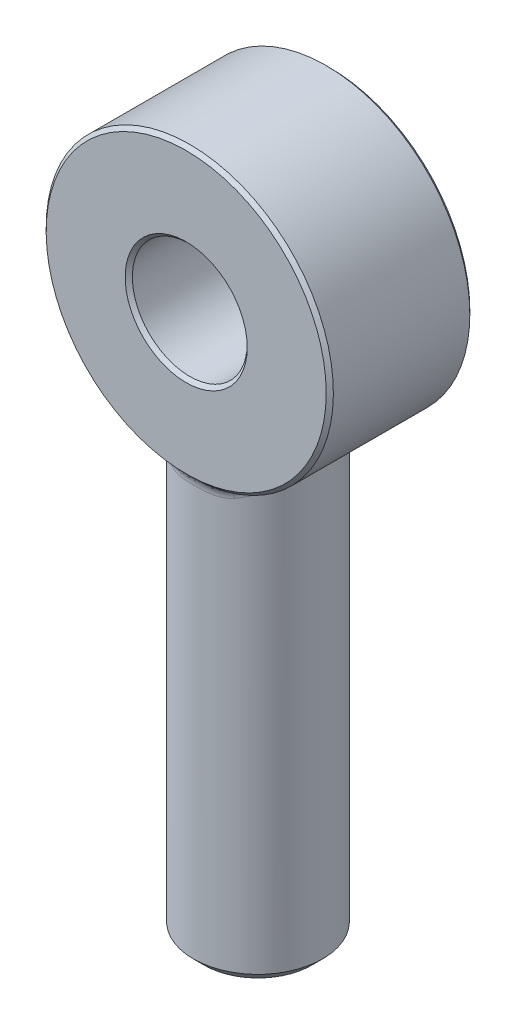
ISO-10303-21;
HEADER;
FILE_DESCRIPTION(('STEP AP214'),'2;1');
FILE_NAME('part.step','',(''),(''),'','','');
FILE_SCHEMA(('AUTOMOTIVE_DESIGN { 1 0 10303 214 1 1 1 1 }'));
ENDSEC;
DATA;
#1=APPLICATION_CONTEXT('core data for automotive mechanical design processes');
#2=APPLICATION_PROTOCOL_DEFINITION('international standard','automotive_design',2000,#1);
#3=PRODUCT_CONTEXT('',#1,'mechanical');
#4=PRODUCT('Part','Part','',(#3));
#5=PRODUCT_RELATED_PRODUCT_CATEGORY('part','',(#4));
#6=PRODUCT_DEFINITION_FORMATION('','',#4);
#7=PRODUCT_DEFINITION_CONTEXT('part definition',#1,'design');
#8=PRODUCT_DEFINITION('design','',#6,#7);
#9=PRODUCT_DEFINITION_SHAPE('','',#8);
#10=(LENGTH_UNIT() NAMED_UNIT(*) SI_UNIT(.MILLI.,.METRE.));
#11=(NAMED_UNIT(*) PLANE_ANGLE_UNIT() SI_UNIT($,.RADIAN.));
#12=(NAMED_UNIT(*) SI_UNIT($,.STERADIAN.) SOLID_ANGLE_UNIT());
#13=UNCERTAINTY_MEASURE_WITH_UNIT(LENGTH_MEASURE(1.E-05),#10,'distance_accuracy_value','');
#14=(GEOMETRIC_REPRESENTATION_CONTEXT(3) GLOBAL_UNCERTAINTY_ASSIGNED_CONTEXT((#13)) GLOBAL_UNIT_ASSIGNED_CONTEXT((#10,
#11,#12)) REPRESENTATION_CONTEXT('',''));
#15=CARTESIAN_POINT('',(0.,0.,0.));
#16=DIRECTION('',(0.,0.,1.));
#17=DIRECTION('',(1.,0.,0.));
#18=AXIS2_PLACEMENT_3D('',#15,#16,#17);
#19=CARTESIAN_POINT('',(0.,0.,-10.));
#20=DIRECTION('',(0.,0.,1.));
#21=DIRECTION('',(1.,0.,0.));
#22=AXIS2_PLACEMENT_3D('',#19,#20,#21);
#23=CYLINDRICAL_SURFACE('',#22,20.);
#24=CARTESIAN_POINT('',(0.,0.,9.5));
#25=DIRECTION('',(0.,0.,1.));
#26=DIRECTION('',(1.,0.,0.));
#27=AXIS2_PLACEMENT_3D('',#24,#25,#26);
#28=CIRCLE('',#27,20.);
#29=CARTESIAN_POINT('',(-5.04115295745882,-19.3542444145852,9.5));
#30=VERTEX_POINT('',#29);
#31=CARTESIAN_POINT('',(5.04115295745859,-19.3542444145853,9.5));
#32=VERTEX_POINT('',#31);
#33=EDGE_CURVE('E100',#30,#32,#28,.F.);
#34=ORIENTED_EDGE('',*,*,#33,.T.);
#35=CARTESIAN_POINT('',(2.56736274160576,-19.8345317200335,10.6312964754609));
#36=CARTESIAN_POINT('',(2.0784639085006,-19.8978143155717,8.76000517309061));
#37=CARTESIAN_POINT('',(2.31062646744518,-21.8179848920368,8.69833347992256));
#38=CARTESIAN_POINT('',(2.81103184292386,-19.8030188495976,10.56011856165));
#39=CARTESIAN_POINT('',(2.27951323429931,-19.8778835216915,8.71281202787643));
#40=CARTESIAN_POINT('',(2.52992865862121,-21.7833207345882,8.64009700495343));
#41=CARTESIAN_POINT('',(3.05167970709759,-19.7672775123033,10.4789265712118));
#42=CARTESIAN_POINT('',(2.48061502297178,-19.8549447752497,8.65838774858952));
#43=CARTESIAN_POINT('',(2.74651173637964,-21.7440052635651,8.57366719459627));
#44=CARTESIAN_POINT('',(3.52552696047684,-19.6882715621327,10.29740194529));
#45=CARTESIAN_POINT('',(2.88089483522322,-19.8032045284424,8.53467221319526));
#46=CARTESIAN_POINT('',(3.17297426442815,-21.6570987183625,8.42514704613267));
#47=CARTESIAN_POINT('',(3.75873016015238,-19.6450108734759,10.1970792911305));
#48=CARTESIAN_POINT('',(3.07983131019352,-19.774482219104,8.46557697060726));
#49=CARTESIAN_POINT('',(3.38285714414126,-21.6095119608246,8.34306487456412));
#50=CARTESIAN_POINT('',(4.21584777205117,-19.5520056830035,9.97843531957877));
#51=CARTESIAN_POINT('',(3.47433690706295,-19.7114420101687,8.31243558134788));
#52=CARTESIAN_POINT('',(3.79426299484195,-21.5072062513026,8.16417435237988));
#53=CARTESIAN_POINT('',(4.43978808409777,-19.5022811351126,9.86016921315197));
#54=CARTESIAN_POINT('',(3.66973148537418,-19.6772215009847,8.22864140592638));
#55=CARTESIAN_POINT('',(3.99580927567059,-21.4525092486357,8.06741117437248));
#56=CARTESIAN_POINT('',(4.87804148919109,-19.397308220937,9.60635186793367));
#57=CARTESIAN_POINT('',(4.05642277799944,-19.603543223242,8.04586620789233));
#58=CARTESIAN_POINT('',(4.39023734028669,-21.3370390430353,7.85974243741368));
#59=CARTESIAN_POINT('',(5.09235299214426,-19.3420589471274,9.47079778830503));
#60=CARTESIAN_POINT('',(4.24761002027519,-19.5641602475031,7.94709039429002));
#61=CARTESIAN_POINT('',(4.58311769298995,-21.2762648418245,7.74883455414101));
#62=CARTESIAN_POINT('',(5.75169678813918,-19.1607785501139,9.01728890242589));
#63=CARTESIAN_POINT('',(4.83900505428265,-19.4331525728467,7.6132372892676));
#64=CARTESIAN_POINT('',(5.17652710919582,-21.076856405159,7.37778182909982));
#65=CARTESIAN_POINT('',(6.17783219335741,-19.0265870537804,8.66923797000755));
#66=CARTESIAN_POINT('',(5.23283136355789,-19.3325653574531,7.34977940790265));
#67=CARTESIAN_POINT('',(5.56004897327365,-20.9292457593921,7.09301288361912));
#68=CARTESIAN_POINT('',(6.97367782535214,-18.7495666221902,7.90531247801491));
#69=CARTESIAN_POINT('',(5.98169952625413,-19.1174439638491,6.75334748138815));
#70=CARTESIAN_POINT('',(6.27631004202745,-20.624523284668,6.46798293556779));
#71=CARTESIAN_POINT('',(7.34330174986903,-18.6067249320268,7.48933614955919));
#72=CARTESIAN_POINT('',(6.33748580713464,-19.0031879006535,6.42174941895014));
#73=CARTESIAN_POINT('',(6.6089715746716,-20.4673974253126,6.12763866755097));
#74=CARTESIAN_POINT('',(8.04989829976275,-18.3127880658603,6.55674299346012));
#75=CARTESIAN_POINT('',(7.02508974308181,-18.7624875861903,5.66203806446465));
#76=CARTESIAN_POINT('',(7.24490847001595,-20.1440668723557,5.3646079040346));
#77=CARTESIAN_POINT('',(8.38093731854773,-18.1621072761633,6.03443766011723));
#78=CARTESIAN_POINT('',(7.35452288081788,-18.6354430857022,5.22798260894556));
#79=CARTESIAN_POINT('',(7.54284358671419,-19.9783180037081,4.9372671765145));
#80=CARTESIAN_POINT('',(8.81387643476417,-17.9538683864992,5.20611874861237));
#81=CARTESIAN_POINT('',(7.7898902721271,-18.4564831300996,4.52579346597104));
#82=CARTESIAN_POINT('',(7.93248879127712,-19.749255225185,4.25955170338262));
#83=CARTESIAN_POINT('',(8.94763210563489,-17.8873932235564,4.92239778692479));
#84=CARTESIAN_POINT('',(7.92477521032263,-18.3989998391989,4.28455656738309));
#85=CARTESIAN_POINT('',(8.05286889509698,-19.6761325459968,4.02741637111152));
#86=CARTESIAN_POINT('',(9.19279278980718,-17.7626416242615,4.34146920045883));
#87=CARTESIAN_POINT('',(8.1727255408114,-18.2905018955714,3.78783728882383));
#88=CARTESIAN_POINT('',(8.27351351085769,-19.5389057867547,3.55211116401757));
#89=CARTESIAN_POINT('',(9.30420989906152,-17.7043607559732,4.04426898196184));
#90=CARTESIAN_POINT('',(8.28612041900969,-18.2393687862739,3.53217895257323));
#91=CARTESIAN_POINT('',(8.37378890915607,-19.474796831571,3.30894734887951));
#92=CARTESIAN_POINT('',(9.50077591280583,-17.5996406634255,3.44644586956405));
#93=CARTESIAN_POINT('',(8.48654315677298,-18.1471203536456,3.01572813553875));
#94=CARTESIAN_POINT('',(8.55069832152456,-19.3596047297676,2.81981934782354));
#95=CARTESIAN_POINT('',(9.58655198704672,-17.5529245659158,3.1461312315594));
#96=CARTESIAN_POINT('',(8.57445688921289,-18.1056664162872,2.75503781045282));
#97=CARTESIAN_POINT('',(8.62789678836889,-19.3082170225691,2.57410737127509));
#98=CARTESIAN_POINT('',(9.73469266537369,-17.4712029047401,2.53667627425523));
#99=CARTESIAN_POINT('',(8.72639189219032,-18.0329959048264,2.22456976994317));
#100=CARTESIAN_POINT('',(8.76122339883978,-19.2183231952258,2.07546240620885));
#101=CARTESIAN_POINT('',(9.79705767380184,-17.4361971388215,2.22753610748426));
#102=CARTESIAN_POINT('',(8.79064056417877,-18.0016763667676,1.95444898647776));
#103=CARTESIAN_POINT('',(8.8173519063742,-19.179816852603,1.82252954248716));
#104=CARTESIAN_POINT('',(9.89738554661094,-17.3794445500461,1.60338762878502));
#105=CARTESIAN_POINT('',(8.89396794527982,-17.9508719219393,1.40828749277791));
#106=CARTESIAN_POINT('',(8.90764699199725,-19.1173890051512,1.31186260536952));
#107=CARTESIAN_POINT('',(9.93537526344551,-17.3576831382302,1.28838616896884));
#108=CARTESIAN_POINT('',(8.93323862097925,-17.9312950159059,1.13184535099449));
#109=CARTESIAN_POINT('',(8.94183773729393,-19.0934514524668,1.05413413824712));
#110=CARTESIAN_POINT('',(9.98642641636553,-17.3283633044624,0.655167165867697));
#111=CARTESIAN_POINT('',(8.98594569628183,-17.9049439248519,0.575983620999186));
#112=CARTESIAN_POINT('',(8.98778377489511,-19.0611996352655,0.536045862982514));
#113=CARTESIAN_POINT('',(9.99949121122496,-17.3208029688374,0.336950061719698));
#114=CARTESIAN_POINT('',(8.99947289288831,-17.8981245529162,0.296110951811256));
#115=CARTESIAN_POINT('',(8.99954209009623,-19.0528832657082,0.275686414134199));
#116=CARTESIAN_POINT('',(10.000417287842,-17.3202661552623,-0.259248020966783));
#117=CARTESIAN_POINT('',(9.00043237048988,-17.8976399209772,-0.22781936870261));
#118=CARTESIAN_POINT('',(9.00037555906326,-19.0522927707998,-0.212112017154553));
#119=CARTESIAN_POINT('',(9.99125691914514,-17.3255662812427,-0.537228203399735));
#120=CARTESIAN_POINT('',(8.99095054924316,-17.902419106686,-0.472264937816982));
#121=CARTESIAN_POINT('',(8.9921312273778,-19.0581229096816,-0.439550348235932));
#122=CARTESIAN_POINT('',(9.95388455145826,-17.3470645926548,-1.09111800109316));
#123=CARTESIAN_POINT('',(8.95235502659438,-17.9217493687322,-0.958647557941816));
#124=CARTESIAN_POINT('',(8.95849609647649,-19.0817710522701,-0.892732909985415));
#125=CARTESIAN_POINT('',(9.9256727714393,-17.3632626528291,-1.36702764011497));
#126=CARTESIAN_POINT('',(8.92319262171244,-17.9363247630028,-1.20088972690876));
#127=CARTESIAN_POINT('',(8.9331054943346,-19.0995889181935,-1.11847716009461));
#128=CARTESIAN_POINT('',(9.85054664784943,-17.4059930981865,-1.91479898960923));
#129=CARTESIAN_POINT('',(8.84575050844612,-17.9746317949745,-1.68076555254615));
#130=CARTESIAN_POINT('',(8.86549198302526,-19.1465924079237,-1.56665371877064));
#131=CARTESIAN_POINT('',(9.80363006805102,-17.432526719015,-2.18666021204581));
#132=CARTESIAN_POINT('',(8.79737315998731,-17.9984109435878,-1.91868155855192));
#133=CARTESIAN_POINT('',(8.82326706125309,-19.1757793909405,-1.7890856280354));
#134=CARTESIAN_POINT('',(9.69168016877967,-17.4950108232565,-2.72442758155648));
#135=CARTESIAN_POINT('',(8.68233303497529,-18.0541494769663,-2.38793558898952));
#136=CARTESIAN_POINT('',(8.72251215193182,-19.2445119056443,-2.22907711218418));
#137=CARTESIAN_POINT('',(9.62664620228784,-17.5309616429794,-2.9903335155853));
#138=CARTESIAN_POINT('',(8.61553503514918,-18.0861718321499,-2.61952085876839));
#139=CARTESIAN_POINT('',(8.66398158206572,-19.2840578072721,-2.44663651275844));
#140=CARTESIAN_POINT('',(9.40741013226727,-17.6501638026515,-3.76934238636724));
#141=CARTESIAN_POINT('',(8.39069275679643,-18.1920020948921,-3.29697795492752));
#142=CARTESIAN_POINT('',(8.46666911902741,-19.4151801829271,-3.08400740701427));
#143=CARTESIAN_POINT('',(9.22792292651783,-17.7454598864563,-4.27190826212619));
#144=CARTESIAN_POINT('',(8.20705599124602,-18.2761453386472,-3.73074952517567));
#145=CARTESIAN_POINT('',(8.30513063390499,-19.520005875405,-3.49519766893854));
#146=CARTESIAN_POINT('',(8.80690910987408,-17.958109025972,-5.23815215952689));
#147=CARTESIAN_POINT('',(7.78183166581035,-18.4606808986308,-4.55557166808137));
#148=CARTESIAN_POINT('',(7.92621819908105,-19.7539199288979,-4.28576085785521));
#149=CARTESIAN_POINT('',(8.56534855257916,-18.0754741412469,-5.70180871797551));
#150=CARTESIAN_POINT('',(7.53870583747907,-18.5616139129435,-4.94739471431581));
#151=CARTESIAN_POINT('',(7.708813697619,-19.8830215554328,-4.66511622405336));
#152=CARTESIAN_POINT('',(7.99313840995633,-18.336306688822,-6.63683329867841));
#153=CARTESIAN_POINT('',(6.97100375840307,-18.7815200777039,-5.72739713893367));
#154=CARTESIAN_POINT('',(7.19382456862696,-20.1699373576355,-5.43013633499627));
#155=CARTESIAN_POINT('',(7.65525079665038,-18.4812145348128,-7.1023632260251));
#156=CARTESIAN_POINT('',(6.63883815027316,-18.9013949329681,-6.10857240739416));
#157=CARTESIAN_POINT('',(6.8897257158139,-20.3293359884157,-5.81102445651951));
#158=CARTESIAN_POINT('',(6.91559503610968,-18.7705029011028,-7.96765491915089));
#159=CARTESIAN_POINT('',(5.92703448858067,-19.1340720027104,-6.80349570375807));
#160=CARTESIAN_POINT('',(6.2240355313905,-20.647553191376,-6.51899038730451));
#161=CARTESIAN_POINT('',(6.51384187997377,-18.9148835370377,-8.3674320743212));
#162=CARTESIAN_POINT('',(5.54595540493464,-19.2468591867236,-7.11620252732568));
#163=CARTESIAN_POINT('',(5.86245769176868,-20.8063718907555,-6.84608078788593));
#164=CARTESIAN_POINT('',(5.85340618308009,-19.1258093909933,-8.92440555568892));
#165=CARTESIAN_POINT('',(4.93743194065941,-19.4058183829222,-7.54025273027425));
#166=CARTESIAN_POINT('',(5.26806556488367,-21.0383903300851,-7.30178636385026));
#167=CARTESIAN_POINT('',(5.61455228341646,-19.1974546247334,-9.10824655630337));
#168=CARTESIAN_POINT('',(4.71875954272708,-19.4589867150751,-7.6785565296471));
#169=CARTESIAN_POINT('',(5.05309705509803,-21.1172000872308,-7.45220172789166));
#170=CARTESIAN_POINT('',(5.12187770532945,-19.3347276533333,-9.45306201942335));
#171=CARTESIAN_POINT('',(4.2734607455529,-19.5590553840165,-7.93447420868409));
#172=CARTESIAN_POINT('',(4.60968993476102,-21.2682004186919,-7.73432347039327));
#173=CARTESIAN_POINT('',(4.86805857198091,-19.4003560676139,-9.61403883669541));
#174=CARTESIAN_POINT('',(4.04689632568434,-19.6058484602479,-8.05175978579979));
#175=CARTESIAN_POINT('',(4.38125271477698,-21.3403916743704,-7.86603177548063));
#176=CARTESIAN_POINT('',(4.34621090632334,-19.5238939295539,-9.91203753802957));
#177=CARTESIAN_POINT('',(3.58724287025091,-19.6923335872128,-8.26591119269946));
#178=CARTESIAN_POINT('',(3.91158981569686,-21.4762833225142,-8.10984889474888));
#179=CARTESIAN_POINT('',(4.07814134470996,-19.5817791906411,-10.0489847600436));
#180=CARTESIAN_POINT('',(3.3543383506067,-19.7318734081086,-8.36236005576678));
#181=CARTESIAN_POINT('',(3.67032721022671,-21.5399571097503,-8.22189662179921));
#182=CARTESIAN_POINT('',(3.53023740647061,-19.6879620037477,-10.2969291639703));
#183=CARTESIAN_POINT('',(2.88409569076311,-19.803193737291,-8.53474834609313));
#184=CARTESIAN_POINT('',(3.17721366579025,-21.6567582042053,-8.42476022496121));
#185=CARTESIAN_POINT('',(3.25039541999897,-19.7362532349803,-10.407909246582));
#186=CARTESIAN_POINT('',(2.64708083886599,-19.8348368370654,-8.6103372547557));
#187=CARTESIAN_POINT('',(2.92535587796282,-21.7098785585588,-8.51556211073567));
#188=CARTESIAN_POINT('',(2.96571061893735,-19.7788917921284,-10.5051186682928));
#189=CARTESIAN_POINT('',(2.4100473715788,-19.8622097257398,-8.67555612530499));
#190=CARTESIAN_POINT('',(2.66913955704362,-21.7567809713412,-8.59509709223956));
#191=(BOUNDED_SURFACE() B_SPLINE_SURFACE(3,2,((#35,#36,#37),(#38,#39,#40),(#41,#42,#43),(#44,
#45,#46),(#47,#48,#49),(#50,#51,#52),(#53,#54,#55),(#56,#57,#58),(#59,#60,#61),(#62,#63,#64),
(#65,#66,#67),(#68,#69,#70),(#71,#72,#73),(#74,#75,#76),(#77,#78,#79),(#80,#81,#82),(#83,#84,
#85),(#86,#87,#88),(#89,#90,#91),(#92,#93,#94),(#95,#96,#97),(#98,#99,#100),(#101,#102,#103),
(#104,#105,#106),(#107,#108,#109),(#110,#111,#112),(#113,#114,#115),(#116,#117,#118),(#119,#120,
#121),(#122,#123,#124),(#125,#126,#127),(#128,#129,#130),(#131,#132,#133),(#134,#135,#136),
(#137,#138,#139),(#140,#141,#142),(#143,#144,#145),(#146,#147,#148),(#149,#150,#151),(#152,#153,
#154),(#155,#156,#157),(#158,#159,#160),(#161,#162,#163),(#164,#165,#166),(#167,#168,#169),
(#170,#171,#172),(#173,#174,#175),(#176,#177,#178),(#179,#180,#181),(#182,#183,#184),(#185,#186,
#187),(#188,#189,#190)),.UNSPECIFIED.,.F.,.F.,.F.) B_SPLINE_SURFACE_WITH_KNOTS((4,2,2,2,2,2,2,2,
2,2,2,2,2,2,2,2,2,2,2,2,2,2,2,2,2,4),(3,3),(0.,0.83812468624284,1.67581327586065,
2.5109747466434,3.34627363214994,5.14470484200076,6.94585569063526,8.90912892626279,
9.89165055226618,10.8736387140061,11.8291543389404,12.7846534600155,13.7390981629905,
14.6934142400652,15.5270454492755,16.3606670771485,17.1943883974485,18.0281394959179,
19.6710239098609,21.3148086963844,23.1572204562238,24.9992003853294,25.98877087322,
26.9782393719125,27.9707297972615,28.9638719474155),(0.,1.),
.UNSPECIFIED.) GEOMETRIC_REPRESENTATION_ITEM() RATIONAL_B_SPLINE_SURFACE(((1.,0.718664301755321,
1.),(1.,0.720838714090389,1.),(1.,0.723289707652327,1.),(1.,0.728656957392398,1.),(1.,
0.73157297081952,1.),(1.,0.737775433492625,1.),(1.,0.741060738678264,1.),(1.,0.747917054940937,
1.),(1.,0.751488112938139,1.),(1.,0.763059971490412,1.),(1.,0.771420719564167,1.),(1.,
0.788196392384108,1.),(1.,0.796611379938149,1.),(1.,0.813473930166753,1.),(1.,0.821856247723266,
1.),(1.,0.833170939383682,1.),(1.,0.836734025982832,1.),(1.,0.843351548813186,1.),(1.,
0.846406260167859,1.),(1.,0.851848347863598,1.),(1.,0.854251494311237,1.),(1.,0.858429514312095,
1.),(1.,0.860204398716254,1.),(1.,0.863070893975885,1.),(1.,0.864163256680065,1.),(1.,
0.865633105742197,1.),(1.,0.86601068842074,1.),(1.,0.8660374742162,1.),(1.,0.865772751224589,
1.),(1.,0.864695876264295,1.),(1.,0.86388373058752,1.),(1.,0.861731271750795,1.),(1.,
0.860390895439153,1.),(1.,0.857214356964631,1.),(1.,0.855378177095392,1.),(1.,0.849241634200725,
1.),(1.,0.844279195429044,1.),(1.,0.832961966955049,1.),(1.,0.826606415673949,1.),(1.,
0.812129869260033,1.),(1.,0.80388834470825,1.),(1.,0.786952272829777,1.),(1.,0.778257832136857,
1.),(1.,0.765208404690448,1.),(1.,0.760707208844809,1.),(1.,0.751965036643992,1.),(1.,
0.747724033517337,1.),(1.,0.739641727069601,1.),(1.,0.735801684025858,1.),(1.,0.728684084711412,
1.),(1.,0.725406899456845,1.),(1.,0.722487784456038,1.))) REPRESENTATION_ITEM('') SURFACE());
#192=CARTESIAN_POINT('',(0.,-20.,11.));
#193=CARTESIAN_POINT('',(0.867004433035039,-19.9998382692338,10.9997698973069));
#194=CARTESIAN_POINT('',(1.73816795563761,-19.9416515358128,10.8732072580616));
#195=CARTESIAN_POINT('',(3.54964699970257,-19.7076349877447,10.3447230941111));
#196=CARTESIAN_POINT('',(4.47303507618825,-19.5120687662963,9.896277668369));
#197=CARTESIAN_POINT('',(6.21592151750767,-19.0334377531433,8.69853675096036));
#198=CARTESIAN_POINT('',(7.0146757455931,-18.7433959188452,7.92283676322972));
#199=CARTESIAN_POINT('',(8.42925186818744,-18.1550190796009,6.05631850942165));
#200=CARTESIAN_POINT('',(9.01096926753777,-17.8599724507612,4.93863535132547));
#201=CARTESIAN_POINT('',(9.79384252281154,-17.4441172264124,2.55262712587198));
#202=CARTESIAN_POINT('',(9.99773773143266,-17.3220559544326,1.28545783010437));
#203=CARTESIAN_POINT('',(10.0019522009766,-17.3191694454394,-1.0895987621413));
#204=CARTESIAN_POINT('',(9.84954897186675,-17.4100871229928,-2.19758946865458));
#205=CARTESIAN_POINT('',(9.2648834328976,-17.727346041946,-4.27646628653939));
#206=CARTESIAN_POINT('',(8.84100697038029,-17.9496144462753,-5.25043210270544));
#207=CARTESIAN_POINT('',(7.69997311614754,-18.4701654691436,-7.11690303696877));
#208=CARTESIAN_POINT('',(6.95945072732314,-18.7735553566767,-7.99370540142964));
#209=CARTESIAN_POINT('',(5.17093382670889,-19.3427426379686,-9.49779912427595));
#210=CARTESIAN_POINT('',(4.11097294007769,-19.6063326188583,-10.1125875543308));
#211=CARTESIAN_POINT('',(2.4400551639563,-19.8580934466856,-10.6852836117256));
#212=CARTESIAN_POINT('',(1.89642968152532,-19.9181180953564,-10.8186267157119));
#213=CARTESIAN_POINT('',(0.329690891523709,-20.0221296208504,-11.0499805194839));
#214=CARTESIAN_POINT('',(-0.718802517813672,-20.0119780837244,-11.0279677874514));
#215=CARTESIAN_POINT('',(-2.74022118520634,-19.838187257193,-10.6405121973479));
#216=CARTESIAN_POINT('',(-3.71236327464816,-19.6731380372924,-10.2719145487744));
#217=CARTESIAN_POINT('',(-5.53172814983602,-19.244093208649,-9.23723435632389));
#218=CARTESIAN_POINT('',(-6.36765043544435,-18.9746556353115,-8.55431146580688));
#219=CARTESIAN_POINT('',(-7.8935581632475,-18.3968367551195,-6.87069315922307));
#220=CARTESIAN_POINT('',(-8.54988333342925,-18.0879948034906,-5.84001441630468));
#221=CARTESIAN_POINT('',(-9.5357651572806,-17.5898852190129,-3.55260881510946));
#222=CARTESIAN_POINT('',(-9.8515734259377,-17.405753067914,-2.28863137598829));
#223=CARTESIAN_POINT('',(-10.0534092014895,-17.2899459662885,0.141713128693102));
#224=CARTESIAN_POINT('',(-9.98366012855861,-17.3322764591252,1.30313163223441));
#225=CARTESIAN_POINT('',(-9.54253909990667,-17.5780330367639,3.45773189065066));
#226=CARTESIAN_POINT('',(-9.19304654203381,-17.7697475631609,4.45700479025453));
#227=CARTESIAN_POINT('',(-8.21314819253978,-18.2444973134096,6.37841143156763));
#228=CARTESIAN_POINT('',(-7.56404803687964,-18.5331911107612,7.28954017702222));
#229=CARTESIAN_POINT('',(-5.9496327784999,-19.1149538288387,8.92885647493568));
#230=CARTESIAN_POINT('',(-4.96482701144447,-19.4068263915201,9.63902440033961));
#231=CARTESIAN_POINT('',(-2.99679131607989,-19.7936315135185,10.5447463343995));
#232=CARTESIAN_POINT('',(-2.05621564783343,-19.9169690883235,10.8168159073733));
#233=CARTESIAN_POINT('',(-0.905459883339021,-19.980460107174,10.9569346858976));
#234=CARTESIAN_POINT('',(-0.712800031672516,-19.988227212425,10.9740809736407));
#235=CARTESIAN_POINT('',(-0.346761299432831,-19.9977420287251,10.9950351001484));
#236=CARTESIAN_POINT('',(-0.173463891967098,-20.0000323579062,11.0000460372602));
#237=CARTESIAN_POINT('',(0.,-20.,11.));
#238=B_SPLINE_CURVE_WITH_KNOTS('',3,(#192,#193,#194,#195,#196,#197,#198,#199,#200,#201,#202,
#203,#204,#205,#206,#207,#208,#209,#210,#211,#212,#213,#214,#215,#216,#217,#218,#219,#220,#221,
#222,#223,#224,#225,#226,#227,#228,#229,#230,#231,#232,#233,#234,#235,#236,#237),.UNSPECIFIED.,
.T.,.F.,(4,2,2,2,2,2,2,2,2,2,2,2,2,2,2,2,2,2,2,2,2,2,4),(0.,2.59897546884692,5.67778485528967,
9.07629333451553,12.8885026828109,16.672962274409,19.9841886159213,23.1977638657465,
26.7065529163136,30.3678673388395,32.0483468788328,35.1159954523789,38.2118404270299,
41.4973330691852,45.2149991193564,49.077714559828,52.5072735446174,55.6920946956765,
59.1101027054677,62.7755611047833,65.6752399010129,66.2556689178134,66.7756528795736),.UNSPECIFIED.);
#239=CARTESIAN_POINT('',(5.0411529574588,-19.3542444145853,-9.50000000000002));
#240=VERTEX_POINT('',#239);
#241=EDGE_CURVE('E11',#32,#240,#238,.T.);
#242=ORIENTED_EDGE('',*,*,#241,.T.);
#243=CARTESIAN_POINT('',(0.,0.,-9.50000000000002));
#244=DIRECTION('',(0.,0.,1.));
#245=DIRECTION('',(1.,0.,0.));
#246=AXIS2_PLACEMENT_3D('',#243,#244,#245);
#247=CIRCLE('',#246,20.);
#248=CARTESIAN_POINT('',(-5.0411529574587,-19.3542444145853,-9.50000000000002));
#249=VERTEX_POINT('',#248);
#250=EDGE_CURVE('E369',#240,#249,#247,.T.);
#251=ORIENTED_EDGE('',*,*,#250,.T.);
#252=CARTESIAN_POINT('',(-3.86603002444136,-19.6227880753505,10.1447085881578));
#253=CARTESIAN_POINT('',(-3.17347082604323,-19.7592342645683,8.42847208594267));
#254=CARTESIAN_POINT('',(-3.47942702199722,-21.5850668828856,8.30021611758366));
#255=CARTESIAN_POINT('',(-3.60327656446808,-19.6745549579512,10.2658684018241));
#256=CARTESIAN_POINT('',(-2.94651383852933,-19.7942704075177,8.51331571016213));
#257=CARTESIAN_POINT('',(-3.24294890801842,-21.6420104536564,8.39934687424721));
#258=CARTESIAN_POINT('',(-3.33506652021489,-19.7219042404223,10.3750126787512));
#259=CARTESIAN_POINT('',(-2.71895799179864,-19.8254063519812,8.58790206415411));
#260=CARTESIAN_POINT('',(-3.00155986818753,-21.6940946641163,8.4886467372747));
#261=CARTESIAN_POINT('',(-2.78977227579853,-19.8063938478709,10.5679690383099));
#262=CARTESIAN_POINT('',(-2.26139099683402,-19.8801640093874,8.71834340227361));
#263=CARTESIAN_POINT('',(-2.51079504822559,-21.7870332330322,8.64652012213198));
#264=CARTESIAN_POINT('',(-2.51269223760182,-19.8435388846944,10.6517928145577));
#265=CARTESIAN_POINT('',(-2.03176890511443,-19.9036800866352,8.77394045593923));
#266=CARTESIAN_POINT('',(-2.26142301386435,-21.8278927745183,8.71510321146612));
#267=CARTESIAN_POINT('',(-1.95189861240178,-19.9065231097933,10.7930571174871));
#268=CARTESIAN_POINT('',(-1.57105731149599,-19.9431348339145,8.86691603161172));
#269=CARTESIAN_POINT('',(-1.75670875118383,-21.8971754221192,8.83068309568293));
#270=CARTESIAN_POINT('',(-1.66818828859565,-19.9323677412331,10.850510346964));
#271=CARTESIAN_POINT('',(-1.34044555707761,-19.958989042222,8.90409347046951));
#272=CARTESIAN_POINT('',(-1.50136945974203,-21.9256045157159,8.87769028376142));
#273=CARTESIAN_POINT('',(-1.09649341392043,-19.9719745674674,10.9382805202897));
#274=CARTESIAN_POINT('',(-0.878244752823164,-19.9831656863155,8.96070204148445));
#275=CARTESIAN_POINT('',(-0.986844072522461,-21.9691720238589,8.94950224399));
#276=CARTESIAN_POINT('',(-0.80850929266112,-19.9857379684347,10.9686001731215));
#277=CARTESIAN_POINT('',(-0.647197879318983,-19.9914307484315,8.97999841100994));
#278=CARTESIAN_POINT('',(-0.727658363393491,-21.9843117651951,8.97430923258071));
#279=CARTESIAN_POINT('',(-0.259852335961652,-20.0000023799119,11.0000119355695));
#280=CARTESIAN_POINT('',(-0.207633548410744,-20.000008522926,9.00002167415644));
#281=CARTESIAN_POINT('',(-0.233867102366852,-22.0000026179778,9.00000976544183));
#282=CARTESIAN_POINT('',(0.000668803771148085,-20.0016930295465,11.0037258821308));
#283=CARTESIAN_POINT('',(0.000409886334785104,-20.0010173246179,9.00237404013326));
#284=CARTESIAN_POINT('',(0.000601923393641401,-22.0018623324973,9.003048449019));
#285=CARTESIAN_POINT('',(0.521043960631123,-19.9949045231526,10.9887877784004));
#286=CARTESIAN_POINT('',(0.416872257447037,-19.9969419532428,8.99286399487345));
#287=CARTESIAN_POINT('',(0.468939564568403,-21.9943949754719,8.99082636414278));
#288=CARTESIAN_POINT('',(0.780898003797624,-19.9864257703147,10.9701366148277));
#289=CARTESIAN_POINT('',(0.624867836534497,-19.9918662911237,8.98102144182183));
#290=CARTESIAN_POINT('',(0.702808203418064,-21.9850683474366,8.9755663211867));
#291=CARTESIAN_POINT('',(1.29795146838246,-19.9595175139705,10.910696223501));
#292=CARTESIAN_POINT('',(1.04100652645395,-19.9755617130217,8.94290465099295));
#293=CARTESIAN_POINT('',(1.16815632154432,-21.9554692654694,8.92693327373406));
#294=CARTESIAN_POINT('',(1.55515114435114,-19.9410889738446,10.8699091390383));
#295=CARTESIAN_POINT('',(1.24874206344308,-19.9643657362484,8.91670754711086));
#296=CARTESIAN_POINT('',(1.39963602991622,-21.9351978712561,8.89356202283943));
#297=CARTESIAN_POINT('',(2.0650567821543,-19.8947503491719,10.766676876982));
#298=CARTESIAN_POINT('',(1.66398708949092,-19.9357472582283,8.84951455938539));
#299=CARTESIAN_POINT('',(1.85855110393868,-21.8842253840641,8.80909926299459));
#300=CARTESIAN_POINT('',(2.31776268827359,-19.8668401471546,10.7042314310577));
#301=CARTESIAN_POINT('',(1.87112312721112,-19.9183786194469,8.80864594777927));
#302=CARTESIAN_POINT('',(2.08598641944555,-21.8535241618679,8.75800753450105));
#303=CARTESIAN_POINT('',(2.810490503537,-19.8030610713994,10.5602527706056));
#304=CARTESIAN_POINT('',(2.27919526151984,-19.8779055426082,8.71291492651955));
#305=CARTESIAN_POINT('',(2.52944145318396,-21.7833671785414,8.64020681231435));
#306=CARTESIAN_POINT('',(3.05067139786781,-19.7674173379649,10.4792565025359));
#307=CARTESIAN_POINT('',(2.47981787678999,-19.8550313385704,8.65861047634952));
#308=CARTESIAN_POINT('',(2.74560425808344,-21.7441590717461,8.57393713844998));
#309=CARTESIAN_POINT('',(3.5237512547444,-19.6885957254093,10.2981381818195));
#310=CARTESIAN_POINT('',(2.87934678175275,-19.8034208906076,8.53517407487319));
#311=CARTESIAN_POINT('',(3.17137612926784,-21.6574552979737,8.4257494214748));
#312=CARTESIAN_POINT('',(3.75664781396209,-19.6454153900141,10.1980098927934));
#313=CARTESIAN_POINT('',(3.07801163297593,-19.7747584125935,8.46622419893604));
#314=CARTESIAN_POINT('',(3.38098303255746,-21.6099569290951,8.34382627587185));
#315=CARTESIAN_POINT('',(4.44236490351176,-19.5059563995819,9.87021949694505));
#316=CARTESIAN_POINT('',(3.66739655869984,-19.6806203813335,8.23760834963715));
#317=CARTESIAN_POINT('',(3.99812841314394,-21.4565520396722,8.07563413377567));
#318=CARTESIAN_POINT('',(4.88257241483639,-19.3997111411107,9.61504557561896));
#319=CARTESIAN_POINT('',(4.05570010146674,-19.6066567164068,8.05542766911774));
#320=CARTESIAN_POINT('',(4.39431517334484,-21.3396822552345,7.86685547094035));
#321=CARTESIAN_POINT('',(5.75219849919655,-19.1606675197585,9.01699028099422));
#322=CARTESIAN_POINT('',(4.83935470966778,-19.4330920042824,7.61303918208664));
#323=CARTESIAN_POINT('',(5.17697864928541,-21.0767342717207,7.37753750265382));
#324=CARTESIAN_POINT('',(6.17825419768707,-19.026464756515,8.66891685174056));
#325=CARTESIAN_POINT('',(5.23318864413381,-19.3324800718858,7.34954535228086));
#326=CARTESIAN_POINT('',(5.56042877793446,-20.9291112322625,7.09275015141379));
#327=CARTESIAN_POINT('',(6.97388091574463,-18.7494712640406,7.90503332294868));
#328=CARTESIAN_POINT('',(5.98193311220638,-19.1173598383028,6.75311189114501));
#329=CARTESIAN_POINT('',(6.27649282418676,-20.6244183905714,6.46775453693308));
#330=CARTESIAN_POINT('',(7.34341059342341,-18.6066743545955,7.48917410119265));
#331=CARTESIAN_POINT('',(6.33760457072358,-19.00314348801,6.42161113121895));
#332=CARTESIAN_POINT('',(6.60906953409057,-20.4673417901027,6.12750608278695));
#333=CARTESIAN_POINT('',(8.04989393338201,-18.3127956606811,6.55676881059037));
#334=CARTESIAN_POINT('',(7.02507447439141,-18.7624959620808,5.66206248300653));
#335=CARTESIAN_POINT('',(7.24490454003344,-20.1440752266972,5.36462902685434));
#336=CARTESIAN_POINT('',(8.38088797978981,-18.162130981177,6.03452043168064));
#337=CARTESIAN_POINT('',(7.35447202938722,-18.6354633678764,5.22805160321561));
#338=CARTESIAN_POINT('',(7.54279918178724,-19.978344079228,4.93733489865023));
#339=CARTESIAN_POINT('',(8.81381832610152,-17.9538963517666,5.20623575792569));
#340=CARTESIAN_POINT('',(7.78983289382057,-18.4565070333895,4.52589246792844));
#341=CARTESIAN_POINT('',(7.93243649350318,-19.7492859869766,4.25964743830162));
#342=CARTESIAN_POINT('',(8.94758904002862,-17.8874146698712,4.92249310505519));
#343=CARTESIAN_POINT('',(7.9247319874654,-18.3990183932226,4.28463785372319));
#344=CARTESIAN_POINT('',(8.0528301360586,-19.6761561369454,4.02749435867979));
#345=CARTESIAN_POINT('',(9.19277473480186,-17.7626512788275,4.34151870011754));
#346=CARTESIAN_POINT('',(8.1727067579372,-18.2905104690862,3.78788016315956));
#347=CARTESIAN_POINT('',(8.27349726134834,-19.5389164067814,3.5521516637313));
#348=CARTESIAN_POINT('',(9.30420171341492,-17.7043651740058,4.0442942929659));
#349=CARTESIAN_POINT('',(8.28611192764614,-18.2393727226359,3.53220099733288));
#350=CARTESIAN_POINT('',(8.37378154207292,-19.4748016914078,3.30896805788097));
#351=CARTESIAN_POINT('',(9.50077724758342,-17.5996398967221,3.44644140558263));
#352=CARTESIAN_POINT('',(8.48654459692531,-18.1471196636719,3.01572426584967));
#353=CARTESIAN_POINT('',(8.55069952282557,-19.3596038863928,2.81981569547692));
#354=CARTESIAN_POINT('',(9.58655458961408,-17.5529231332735,3.14612199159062));
#355=CARTESIAN_POINT('',(8.57445957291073,-18.1056651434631,2.75502980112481));
#356=CARTESIAN_POINT('',(8.62789913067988,-19.3082154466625,2.57409981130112));
#357=CARTESIAN_POINT('',(9.73469690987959,-17.4712005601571,2.53665734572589));
#358=CARTESIAN_POINT('',(8.72639622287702,-18.0329938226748,2.2245532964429));
#359=CARTESIAN_POINT('',(8.76122721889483,-19.2183206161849,2.07544691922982));
#360=CARTESIAN_POINT('',(9.79706229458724,-17.4361945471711,2.22751226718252));
#361=CARTESIAN_POINT('',(8.79064531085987,-18.0016740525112,1.95442817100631));
#362=CARTESIAN_POINT('',(8.817356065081,-19.1798140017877,1.82251003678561));
#363=CARTESIAN_POINT('',(9.89738864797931,-17.3794427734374,1.60336343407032));
#364=CARTESIAN_POINT('',(8.89397115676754,-17.9508703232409,1.40826626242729));
#365=CARTESIAN_POINT('',(8.90764978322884,-19.1173870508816,1.31184280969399));
#366=CARTESIAN_POINT('',(9.93537721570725,-17.3576820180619,1.28836672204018));
#367=CARTESIAN_POINT('',(8.93324063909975,-17.9312940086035,1.13182827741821));
#368=CARTESIAN_POINT('',(8.94183949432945,-19.0934502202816,1.05411822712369));
#369=CARTESIAN_POINT('',(9.9864268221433,-17.3283630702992,0.655157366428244));
#370=CARTESIAN_POINT('',(8.98594611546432,-17.9049437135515,0.575974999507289));
#371=CARTESIAN_POINT('',(8.98778414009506,-19.061199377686,0.536037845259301));
#372=CARTESIAN_POINT('',(9.9994912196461,-17.3208029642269,0.336945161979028));
#373=CARTESIAN_POINT('',(8.99947290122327,-17.898124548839,0.296106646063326));
#374=CARTESIAN_POINT('',(8.99954209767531,-19.0528832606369,0.275682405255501));
#375=CARTESIAN_POINT('',(10.0004172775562,-17.3202661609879,-0.259241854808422));
#376=CARTESIAN_POINT('',(9.00043236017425,-17.8976399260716,-0.227813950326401));
#377=CARTESIAN_POINT('',(9.000375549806,-19.0522927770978,-0.212106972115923));
#378=CARTESIAN_POINT('',(9.99125732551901,-17.3255660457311,-0.537215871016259));
#379=CARTESIAN_POINT('',(8.99095097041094,-17.9024188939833,-0.472254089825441));
#380=CARTESIAN_POINT('',(8.99213159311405,-19.0581226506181,-0.439540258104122));
#381=CARTESIAN_POINT('',(9.95388663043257,-17.3470633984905,-1.0910934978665));
#382=CARTESIAN_POINT('',(8.95235717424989,-17.921748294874,-0.958626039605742));
#383=CARTESIAN_POINT('',(8.95849796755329,-19.0817697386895,-0.892712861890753));
#384=CARTESIAN_POINT('',(9.92567610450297,-17.3632607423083,-1.36699713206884));
#385=CARTESIAN_POINT('',(8.92319606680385,-17.9363230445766,-1.20086294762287));
#386=CARTESIAN_POINT('',(8.93310849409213,-19.0995868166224,-1.1184521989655));
#387=CARTESIAN_POINT('',(9.85055163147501,-17.4059902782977,-1.91476885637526));
#388=CARTESIAN_POINT('',(8.84575564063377,-17.9746292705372,-1.68073919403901));
#389=CARTESIAN_POINT('',(8.86549646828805,-19.1465893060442,-1.56662906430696));
#390=CARTESIAN_POINT('',(9.80363462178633,-17.432524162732,-2.18663627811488));
#391=CARTESIAN_POINT('',(8.79737783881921,-17.9984086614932,-1.91866066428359));
#392=CARTESIAN_POINT('',(8.82327115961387,-19.1757765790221,-1.78906604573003));
#393=CARTESIAN_POINT('',(9.69168304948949,-17.4950092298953,-2.72441580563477));
#394=CARTESIAN_POINT('',(8.68233598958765,-18.0541480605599,-2.38792535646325));
#395=CARTESIAN_POINT('',(8.7225147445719,-19.2445101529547,-2.2290674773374));
#396=CARTESIAN_POINT('',(9.626647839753,-17.5309607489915,-2.99032769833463));
#397=CARTESIAN_POINT('',(8.61553671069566,-18.0861710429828,-2.61951584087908));
#398=CARTESIAN_POINT('',(8.6639830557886,-19.2840568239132,-2.44663175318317));
#399=CARTESIAN_POINT('',(9.4073929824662,-17.6501731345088,-3.76940332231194));
#400=CARTESIAN_POINT('',(8.39067502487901,-18.192010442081,-3.29703132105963));
#401=CARTESIAN_POINT('',(8.4666536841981,-19.4151904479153,-3.08405726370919));
#402=CARTESIAN_POINT('',(9.22788057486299,-17.7454824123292,-4.27202686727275));
#403=CARTESIAN_POINT('',(8.20701231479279,-18.276165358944,-3.73085245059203));
#404=CARTESIAN_POINT('',(8.3050925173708,-19.5200306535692,-3.49529470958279));
#405=CARTESIAN_POINT('',(8.80685195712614,-17.9581367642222,-5.23826185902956));
#406=CARTESIAN_POINT('',(7.78177465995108,-18.4607045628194,-4.55566370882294));
#407=CARTESIAN_POINT('',(7.92616676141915,-19.7539504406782,-4.28585061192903));
#408=CARTESIAN_POINT('',(8.56531640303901,-18.0754887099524,-5.7018610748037));
#409=CARTESIAN_POINT('',(7.53867477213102,-18.5616258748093,-4.94743746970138));
#410=CARTESIAN_POINT('',(7.70878476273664,-19.8830375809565,-4.66515906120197));
#411=CARTESIAN_POINT('',(7.99332139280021,-18.3362233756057,-6.63653449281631));
#412=CARTESIAN_POINT('',(6.97118822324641,-18.7814487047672,-5.72714360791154));
#413=CARTESIAN_POINT('',(7.19398925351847,-20.1698457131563,-5.42989185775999));
#414=CARTESIAN_POINT('',(7.65566021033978,-18.4810392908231,-7.10179968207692));
#415=CARTESIAN_POINT('',(6.63924356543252,-18.9012489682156,-6.10810701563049));
#416=CARTESIAN_POINT('',(6.89009418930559,-20.3291432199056,-5.81056337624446));
#417=CARTESIAN_POINT('',(6.9160812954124,-18.7703277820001,-7.96717051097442));
#418=CARTESIAN_POINT('',(5.92749199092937,-19.1339361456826,-6.80312016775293));
#419=CARTESIAN_POINT('',(6.22447316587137,-20.6473605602,-6.51859405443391));
#420=CARTESIAN_POINT('',(6.51410131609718,-18.9147998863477,-8.36721226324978));
#421=CARTESIAN_POINT('',(5.54619344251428,-19.246796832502,-7.11603778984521));
#422=CARTESIAN_POINT('',(5.86269118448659,-20.8062798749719,-6.84590094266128));
#423=CARTESIAN_POINT('',(5.85270733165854,-19.1260330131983,-8.92499547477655));
#424=CARTESIAN_POINT('',(4.93677536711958,-19.4059899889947,-7.5407096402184));
#425=CARTESIAN_POINT('',(5.26743659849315,-21.0386363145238,-7.3022690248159));
#426=CARTESIAN_POINT('',(5.6131060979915,-19.1978895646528,-9.10936096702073));
#427=CARTESIAN_POINT('',(4.7174230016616,-19.4593118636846,-7.67939995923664));
#428=CARTESIAN_POINT('',(5.05179548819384,-21.1176785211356,-7.45311351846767));
#429=CARTESIAN_POINT('',(5.11892172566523,-19.3355190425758,-9.45502780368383));
#430=CARTESIAN_POINT('',(4.27080392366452,-19.5596272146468,-7.93592437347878));
#431=CARTESIAN_POINT('',(4.60702955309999,-21.2690709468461,-7.73593183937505));
#432=CARTESIAN_POINT('',(4.86434482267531,-19.4012944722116,-9.61633865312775));
#433=CARTESIAN_POINT('',(4.04360195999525,-19.6065145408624,-8.05343420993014));
#434=CARTESIAN_POINT('',(4.37791034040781,-21.341423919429,-7.86791344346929));
#435=CARTESIAN_POINT('',(4.34223762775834,-19.5247744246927,-9.91412463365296));
#436=CARTESIAN_POINT('',(3.58376633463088,-19.692940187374,-8.26738740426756));
#437=CARTESIAN_POINT('',(3.90801386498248,-21.4772518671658,-8.1115565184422));
#438=CARTESIAN_POINT('',(4.07473326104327,-19.5824942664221,-10.0506470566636));
#439=CARTESIAN_POINT('',(3.35133307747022,-19.7323654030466,-8.36352486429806));
#440=CARTESIAN_POINT('',(3.66725993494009,-21.5407436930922,-8.22325668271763));
#441=CARTESIAN_POINT('',(3.52827931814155,-19.6882862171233,-10.2976939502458));
#442=CARTESIAN_POINT('',(2.88251189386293,-19.8033969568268,-8.53526474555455));
#443=CARTESIAN_POINT('',(3.17545138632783,-21.657114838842,-8.42538595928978));
#444=CARTESIAN_POINT('',(3.24933603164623,-19.7363635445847,-10.4082324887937));
#445=CARTESIAN_POINT('',(2.64644935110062,-19.8348763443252,-8.61054518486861));
#446=CARTESIAN_POINT('',(2.92440242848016,-21.7099998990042,-8.51582658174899));
#447=CARTESIAN_POINT('',(2.70185471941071,-19.8184556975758,-10.595251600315));
#448=CARTESIAN_POINT('',(2.18840665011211,-19.8878363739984,-8.73650769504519));
#449=CARTESIAN_POINT('',(2.43166924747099,-21.8003012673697,-8.66884221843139));
#450=CARTESIAN_POINT('',(2.4339466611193,-19.853217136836,-10.6735690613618));
#451=CARTESIAN_POINT('',(1.9668445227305,-19.9097748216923,-8.78832802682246));
#452=CARTESIAN_POINT('',(2.19055199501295,-21.8385388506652,-8.73292014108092));
#453=CARTESIAN_POINT('',(1.89197534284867,-19.9121748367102,-10.8056428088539));
#454=CARTESIAN_POINT('',(1.52228375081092,-19.9466156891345,-8.87508599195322));
#455=CARTESIAN_POINT('',(1.70277780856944,-21.9033923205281,-8.84098047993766));
#456=CARTESIAN_POINT('',(1.61791145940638,-19.9363700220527,-10.8593965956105));
#457=CARTESIAN_POINT('',(1.29971946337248,-19.9614401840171,-8.90983828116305));
#458=CARTESIAN_POINT('',(1.4561203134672,-21.9300070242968,-8.88496085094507));
#459=CARTESIAN_POINT('',(1.0881106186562,-19.9719992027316,-10.938316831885));
#460=CARTESIAN_POINT('',(0.871704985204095,-19.9831626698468,-8.96068916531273));
#461=CARTESIAN_POINT('',(0.979299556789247,-21.969199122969,-8.94953195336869));
#462=CARTESIAN_POINT('',(0.832670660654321,-19.9843024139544,-10.9654333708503));
#463=CARTESIAN_POINT('',(0.666655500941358,-19.9905633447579,-8.97797179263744));
#464=CARTESIAN_POINT('',(0.749403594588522,-21.982732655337,-8.97171821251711));
#465=CARTESIAN_POINT('',(0.320280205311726,-19.9990779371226,-10.9979805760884));
#466=CARTESIAN_POINT('',(0.25597620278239,-19.9994562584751,-8.99873388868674));
#467=CARTESIAN_POINT('',(0.288252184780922,-21.9989857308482,-8.99834774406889));
#468=CARTESIAN_POINT('',(0.0633292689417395,-20.0015472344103,-11.0034045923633));
#469=CARTESIAN_POINT('',(0.0507486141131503,-20.0009292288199,-9.00216835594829));
#470=CARTESIAN_POINT('',(0.0569963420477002,-22.0017019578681,-9.00278557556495));
#471=CARTESIAN_POINT('',(-0.450321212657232,-19.9965806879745,-10.9924765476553));
#472=CARTESIAN_POINT('',(-0.360261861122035,-19.9979480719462,-8.99521192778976));
#473=CARTESIAN_POINT('',(-0.405289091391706,-21.996238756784,-8.99384444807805));
#474=CARTESIAN_POINT('',(-0.707020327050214,-19.9891359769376,-10.9761049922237));
#475=CARTESIAN_POINT('',(-0.565637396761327,-19.9934945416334,-8.98482242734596));
#476=CARTESIAN_POINT('',(-0.636318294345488,-21.9880495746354,-8.98044953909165));
#477=CARTESIAN_POINT('',(-1.2181412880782,-19.9645090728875,-10.9217360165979));
#478=CARTESIAN_POINT('',(-0.976652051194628,-19.9785931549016,-8.94999570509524));
#479=CARTESIAN_POINT('',(-1.0963271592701,-21.9609599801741,-8.93596583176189));
#480=CARTESIAN_POINT('',(-1.47256223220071,-19.947323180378,-10.8837303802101));
#481=CARTESIAN_POINT('',(-1.18189648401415,-19.968171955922,-8.92562086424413));
#482=CARTESIAN_POINT('',(-1.32530600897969,-21.9420554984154,-8.90487031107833));
#483=CARTESIAN_POINT('',(-1.97654246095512,-19.9036953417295,-10.7866514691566));
#484=CARTESIAN_POINT('',(-1.59167119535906,-19.9412958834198,-8.86255852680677));
#485=CARTESIAN_POINT('',(-1.77888821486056,-21.8940648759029,-8.8254421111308));
#486=CARTESIAN_POINT('',(-2.22611288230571,-19.8772781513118,-10.7276345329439));
#487=CARTESIAN_POINT('',(-1.79583756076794,-19.9249068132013,-8.82402650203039));
#488=CARTESIAN_POINT('',(-2.00350159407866,-21.8650059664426,-8.77715552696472));
#489=CARTESIAN_POINT('',(-2.71951239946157,-19.8158042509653,-10.5891278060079));
#490=CARTESIAN_POINT('',(-2.20347274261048,-19.8860479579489,-8.73221510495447));
#491=CARTESIAN_POINT('',(-2.44756115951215,-21.797384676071,-8.66383184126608));
#492=CARTESIAN_POINT('',(-2.96333928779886,-19.7807442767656,-10.5096302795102));
#493=CARTESIAN_POINT('',(-2.40662557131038,-19.8636421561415,-8.67908900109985));
#494=CARTESIAN_POINT('',(-2.66700535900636,-21.7588187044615,-8.59878841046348));
#495=CARTESIAN_POINT('',(-3.44356923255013,-19.7028158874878,-10.3309873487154));
#496=CARTESIAN_POINT('',(-2.81123034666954,-19.8128086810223,-8.55770652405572));
#497=CARTESIAN_POINT('',(-3.09921230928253,-21.6730974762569,-8.45262601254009));
#498=CARTESIAN_POINT('',(-3.6799754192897,-19.6599508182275,-10.2318503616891));
#499=CARTESIAN_POINT('',(-3.01242419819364,-19.7844613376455,-8.48964773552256));
#500=CARTESIAN_POINT('',(-3.31197787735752,-21.6259459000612,-8.37151393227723));
#501=CARTESIAN_POINT('',(-4.14419620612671,-19.5673654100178,-10.0147945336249));
#502=CARTESIAN_POINT('',(-3.41207658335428,-19.721956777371,-8.33809827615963));
#503=CARTESIAN_POINT('',(-3.72977658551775,-21.5241019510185,-8.19392280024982));
#504=CARTESIAN_POINT('',(-4.37200743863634,-19.5176424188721,-9.89686842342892));
#505=CARTESIAN_POINT('',(-3.61034416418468,-19.6878792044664,-8.25481144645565));
#506=CARTESIAN_POINT('',(-3.93480669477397,-21.4694066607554,-8.09743780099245));
#507=CARTESIAN_POINT('',(-5.05679924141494,-19.3559621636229,-9.50712916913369));
#508=CARTESIAN_POINT('',(-4.21043974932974,-19.5752874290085,-7.97622412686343));
#509=CARTESIAN_POINT('',(-4.55111931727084,-21.2915583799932,-7.77856022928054));
#510=CARTESIAN_POINT('',(-5.49797098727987,-19.2343761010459,-9.20574634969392));
#511=CARTESIAN_POINT('',(-4.60826758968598,-19.4876407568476,-7.75506091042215));
#512=CARTESIAN_POINT('',(-4.94817388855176,-21.1578137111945,-7.53197428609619));
#513=CARTESIAN_POINT('',(-6.33003281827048,-18.9768568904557,-8.53457425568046));
#514=CARTESIAN_POINT('',(-5.37428491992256,-19.2943788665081,-7.24519329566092));
#515=CARTESIAN_POINT('',(-5.69702953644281,-20.8745425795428,-6.98283348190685));
#516=CARTESIAN_POINT('',(-6.72089568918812,-18.8409160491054,-8.16474821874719));
#517=CARTESIAN_POINT('',(-5.74262125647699,-19.1892351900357,-6.95813538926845));
#518=CARTESIAN_POINT('',(-6.04880612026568,-20.725007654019,-6.68024854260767));
#519=CARTESIAN_POINT('',(-7.48234625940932,-18.5525242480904,-7.32419507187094));
#520=CARTESIAN_POINT('',(-6.47019448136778,-18.9597243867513,-6.28899579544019));
#521=CARTESIAN_POINT('',(-6.73411163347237,-20.4077766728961,-5.99252324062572));
#522=CARTESIAN_POINT('',(-7.84701507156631,-18.3997798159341,-6.84708085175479));
#523=CARTESIAN_POINT('',(-6.82706961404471,-18.8343497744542,-5.90088504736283));
#524=CARTESIAN_POINT('',(-7.06231356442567,-20.2397577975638,-5.60215706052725));
#525=CARTESIAN_POINT('',(-8.49996577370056,-18.1074279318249,-5.82806105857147));
#526=CARTESIAN_POINT('',(-7.47200847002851,-18.5894171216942,-5.05518869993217));
#527=CARTESIAN_POINT('',(-7.64996919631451,-19.9181707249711,-4.76841359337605));
#528=CARTESIAN_POINT('',(-8.78821859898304,-17.9678254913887,-5.28613094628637));
#529=CARTESIAN_POINT('',(-7.76232719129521,-18.4693939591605,-4.59772194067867));
#530=CARTESIAN_POINT('',(-7.90939673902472,-19.7646080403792,-4.32501622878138));
#531=CARTESIAN_POINT('',(-9.15791834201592,-17.7806636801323,-4.4297353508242));
#532=CARTESIAN_POINT('',(-8.13734001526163,-18.30626136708,-3.86359915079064));
#533=CARTESIAN_POINT('',(-8.24212650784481,-19.5587300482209,-3.62432892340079));
#534=CARTESIAN_POINT('',(-9.27133136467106,-17.7216158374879,-4.13456597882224));
#535=CARTESIAN_POINT('',(-8.25267162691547,-18.2545141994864,-3.60992545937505));
#536=CARTESIAN_POINT('',(-8.34419822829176,-19.4937774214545,-3.38282670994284));
#537=CARTESIAN_POINT('',(-9.47480952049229,-17.6136668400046,-3.53253676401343));
#538=CARTESIAN_POINT('',(-8.4599758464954,-18.1595315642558,-3.09034049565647));
#539=CARTESIAN_POINT('',(-8.52732856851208,-19.3750335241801,-2.89025735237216));
#540=CARTESIAN_POINT('',(-9.56488699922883,-17.5647603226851,-3.22568320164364));
#541=CARTESIAN_POINT('',(-8.5522544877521,-18.1161714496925,-2.82416526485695));
#542=CARTESIAN_POINT('',(-8.60839829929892,-19.3212363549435,-2.63919534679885));
#543=CARTESIAN_POINT('',(-9.72044794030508,-17.4791529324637,-2.60284887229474));
#544=CARTESIAN_POINT('',(-8.71173471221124,-18.0400970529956,-2.28233973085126));
#545=CARTESIAN_POINT('',(-8.7484031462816,-19.2270682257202,-2.1296036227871));
#546=CARTESIAN_POINT('',(-9.7859563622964,-17.4424396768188,-2.28687772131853));
#547=CARTESIAN_POINT('',(-8.77920972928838,-18.0072603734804,-2.00633833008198));
#548=CARTESIAN_POINT('',(-8.8073607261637,-19.1866836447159,-1.87108177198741));
#549=CARTESIAN_POINT('',(-9.89149649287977,-17.3828076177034,-1.64827125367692));
#550=CARTESIAN_POINT('',(-8.88788378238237,-17.9538944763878,-1.44765831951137));
#551=CARTESIAN_POINT('',(-8.90234684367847,-19.1210883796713,-1.34858557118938));
#552=CARTESIAN_POINT('',(-9.93153145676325,-17.3598870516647,-1.32563679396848));
#553=CARTESIAN_POINT('',(-8.92926726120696,-17.9332768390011,-1.16454393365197));
#554=CARTESIAN_POINT('',(-8.93837831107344,-19.0958757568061,-1.08461192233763));
#555=CARTESIAN_POINT('',(-9.9822481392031,-17.3307659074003,-0.715331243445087));
#556=CARTESIAN_POINT('',(-8.98163514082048,-17.9071019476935,-0.628776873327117));
#557=CARTESIAN_POINT('',(-8.98402332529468,-19.0638424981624,-0.585271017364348));
#558=CARTESIAN_POINT('',(-9.99584446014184,-17.322906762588,-0.428044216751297));
#559=CARTESIAN_POINT('',(-8.99570595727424,-17.9000171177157,-0.376181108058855));
#560=CARTESIAN_POINT('',(-8.99626001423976,-19.0551974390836,-0.350217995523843));
#561=CARTESIAN_POINT('',(-10.0025218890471,-17.3190525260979,0.146858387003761));
#562=CARTESIAN_POINT('',(-9.00260518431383,-17.896548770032,0.129024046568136));
#563=CARTESIAN_POINT('',(-9.0022697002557,-19.0509577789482,0.120156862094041));
#564=CARTESIAN_POINT('',(-9.9956079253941,-17.323054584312,0.43447386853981));
#565=CARTESIAN_POINT('',(-8.99544814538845,-17.9001579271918,0.381979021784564));
#566=CARTESIAN_POINT('',(-8.99604713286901,-19.055360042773,0.355478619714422));
#567=CARTESIAN_POINT('',(-9.96137586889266,-17.3427613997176,1.00765836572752));
#568=CARTESIAN_POINT('',(-8.96009190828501,-17.9178804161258,0.885385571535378));
#569=CARTESIAN_POINT('',(-8.96523828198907,-19.0770375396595,0.824447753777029));
#570=CARTESIAN_POINT('',(-9.9340630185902,-17.3584631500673,1.29322788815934));
#571=CARTESIAN_POINT('',(-8.93185007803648,-17.9320150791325,1.1361769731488));
#572=CARTESIAN_POINT('',(-8.94065671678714,-19.0943094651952,1.05809554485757));
#573=CARTESIAN_POINT('',(-9.85939556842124,-17.4009815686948,1.8603393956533));
#574=CARTESIAN_POINT('',(-8.8548664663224,-17.9701440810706,1.63311983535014));
#575=CARTESIAN_POINT('',(-8.87345601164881,-19.1410797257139,1.52209586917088));
#576=CARTESIAN_POINT('',(-9.81202794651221,-17.4278054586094,2.14187864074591));
#577=CARTESIAN_POINT('',(-8.80600971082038,-17.994194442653,1.8795832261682));
#578=CARTESIAN_POINT('',(-8.83082515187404,-19.1705860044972,1.7524461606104));
#579=CARTESIAN_POINT('',(-9.70132498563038,-17.4896554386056,2.68175725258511));
#580=CARTESIAN_POINT('',(-8.69224384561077,-18.0493738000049,2.35071087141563));
#581=CARTESIAN_POINT('',(-8.73119248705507,-19.2386209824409,2.19416502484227));
#582=CARTESIAN_POINT('',(-9.63913731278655,-17.5240827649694,2.9404655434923));
#583=CARTESIAN_POINT('',(-8.62835498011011,-18.0800474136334,2.57607614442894));
#584=CARTESIAN_POINT('',(-8.6752235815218,-19.2764910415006,2.40583544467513));
#585=CARTESIAN_POINT('',(-9.49824615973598,-17.6008450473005,3.45095606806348));
#586=CARTESIAN_POINT('',(-8.48415814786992,-18.148081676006,3.01922551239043));
#587=CARTESIAN_POINT('',(-8.54842154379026,-19.3609295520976,2.82350951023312));
#588=CARTESIAN_POINT('',(-9.41953603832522,-17.6431831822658,3.70273547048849));
#589=CARTESIAN_POINT('',(-8.40369406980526,-18.185510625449,3.23719608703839));
#590=CARTESIAN_POINT('',(-8.47758243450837,-19.4075015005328,3.02951083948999));
#591=CARTESIAN_POINT('',(-9.15952241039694,-17.7803718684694,4.44591022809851));
#592=CARTESIAN_POINT('',(-8.13829247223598,-18.3063598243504,3.87954385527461));
#593=CARTESIAN_POINT('',(-8.24357016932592,-19.5584090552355,3.63756291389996));
#594=CARTESIAN_POINT('',(-8.9543024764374,-17.8854161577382,4.92530183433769));
#595=CARTESIAN_POINT('',(-7.92975321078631,-18.3981024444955,4.28977223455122));
#596=CARTESIAN_POINT('',(-8.05887222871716,-19.673957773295,4.02979240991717));
#597=CARTESIAN_POINT('',(-8.59173487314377,-18.0610764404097,5.63598088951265));
#598=CARTESIAN_POINT('',(-7.56751416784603,-18.5482472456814,4.8886765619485));
#599=CARTESIAN_POINT('',(-7.73256138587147,-19.86718408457,4.61125709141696));
#600=CARTESIAN_POINT('',(-8.45439028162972,-18.1259187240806,5.88185373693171));
#601=CARTESIAN_POINT('',(-7.43036138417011,-18.603454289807,5.09518676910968));
#602=CARTESIAN_POINT('',(-7.60895125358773,-19.9385105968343,4.81242578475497));
#603=CARTESIAN_POINT('',(-8.16320955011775,-18.2589047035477,6.36008259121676));
#604=CARTESIAN_POINT('',(-7.14167064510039,-18.7155276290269,5.49388989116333));
#605=CARTESIAN_POINT('',(-7.34688859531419,-20.0847951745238,5.20370393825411));
#606=CARTESIAN_POINT('',(-8.00938954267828,-18.3270451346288,6.59245148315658));
#607=CARTESIAN_POINT('',(-6.98991558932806,-18.772446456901,5.68610614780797));
#608=CARTESIAN_POINT('',(-7.20845058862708,-20.1597496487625,5.3938239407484));
#609=CARTESIAN_POINT('',(-7.68585875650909,-18.4650624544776,7.04307597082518));
#610=CARTESIAN_POINT('',(-6.67328974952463,-18.8864136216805,6.0557050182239));
#611=CARTESIAN_POINT('',(-6.91727288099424,-20.31156870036,5.7625167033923));
#612=CARTESIAN_POINT('',(-7.51613297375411,-18.5349409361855,7.26131790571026));
#613=CARTESIAN_POINT('',(-6.50820271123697,-18.9434903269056,6.2330152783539));
#614=CARTESIAN_POINT('',(-6.7645196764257,-20.3884350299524,5.94107828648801));
#615=CARTESIAN_POINT('',(-7.16165441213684,-18.6747695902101,7.68260040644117));
#616=CARTESIAN_POINT('',(-6.16649784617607,-19.0562473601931,6.57202485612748));
#617=CARTESIAN_POINT('',(-6.44548897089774,-20.5422465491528,6.28576396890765));
#618=CARTESIAN_POINT('',(-6.97689706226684,-18.744719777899,7.88563631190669));
#619=CARTESIAN_POINT('',(-5.98970937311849,-19.1119285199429,6.73360494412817));
#620=CARTESIAN_POINT('',(-6.27920735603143,-20.6191917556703,6.45188425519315));
#621=CARTESIAN_POINT('',(-6.57311071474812,-18.8903402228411,8.2958846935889));
#622=CARTESIAN_POINT('',(-5.60694454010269,-19.2262789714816,7.05680874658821));
#623=CARTESIAN_POINT('',(-5.91579964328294,-20.7793742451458,6.78754202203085));
#624=CARTESIAN_POINT('',(-6.35251840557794,-18.9658433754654,8.50131221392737));
#625=CARTESIAN_POINT('',(-5.39993354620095,-19.2845475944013,7.21625955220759));
#626=CARTESIAN_POINT('',(-5.71726656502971,-20.8624277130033,6.95561908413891));
#627=CARTESIAN_POINT('',(-5.8951752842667,-19.1129433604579,8.89100618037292));
#628=CARTESIAN_POINT('',(-4.97589466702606,-19.3961614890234,7.51489777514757));
#629=CARTESIAN_POINT('',(-5.30565775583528,-21.0242376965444,7.2744596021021));
#630=CARTESIAN_POINT('',(-5.65842484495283,-19.1845402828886,9.07527311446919));
#631=CARTESIAN_POINT('',(-4.75880690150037,-19.449432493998,7.65380204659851));
#632=CARTESIAN_POINT('',(-5.09258236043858,-21.1029943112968,7.4252234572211));
#633=CARTESIAN_POINT('',(-5.16998739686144,-19.3218940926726,9.42126820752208));
#634=CARTESIAN_POINT('',(-4.31663869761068,-19.549816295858,7.91111555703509));
#635=CARTESIAN_POINT('',(-4.65298865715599,-21.2540835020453,7.7083103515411));
#636=CARTESIAN_POINT('',(-4.91829738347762,-19.3876497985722,9.58299181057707));
#637=CARTESIAN_POINT('',(-4.09161145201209,-19.5968223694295,8.02919532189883));
#638=CARTESIAN_POINT('',(-4.42646764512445,-21.3264147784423,7.84062966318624));
#639=CARTESIAN_POINT('',(-4.40167380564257,-19.5114265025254,9.88228871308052));
#640=CARTESIAN_POINT('',(-3.63573818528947,-19.683714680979,8.24474750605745));
#641=CARTESIAN_POINT('',(-3.96150642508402,-21.4625691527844,8.08550894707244));
#642=CARTESIAN_POINT('',(-4.13674811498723,-19.5694520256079,10.0198761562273));
#643=CARTESIAN_POINT('',(-3.40507460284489,-19.7234807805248,8.34189134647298));
#644=CARTESIAN_POINT('',(-3.72307330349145,-21.5263972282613,8.19808049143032));
#645=CARTESIAN_POINT('',(-3.86603002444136,-19.6227880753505,10.1447085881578));
#646=CARTESIAN_POINT('',(-3.17347082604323,-19.7592342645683,8.42847208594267));
#647=CARTESIAN_POINT('',(-3.47942702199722,-21.5850668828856,8.30021611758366));
#648=(BOUNDED_SURFACE() B_SPLINE_SURFACE(3,2,((#252,#253,#254),(#255,#256,#257),(#258,#259,
#260),(#261,#262,#263),(#264,#265,#266),(#267,#268,#269),(#270,#271,#272),(#273,#274,#275),
(#276,#277,#278),(#279,#280,#281),(#282,#283,#284),(#285,#286,#287),(#288,#289,#290),(#291,#292,
#293),(#294,#295,#296),(#297,#298,#299),(#300,#301,#302),(#303,#304,#305),(#306,#307,#308),
(#309,#310,#311),(#312,#313,#314),(#315,#316,#317),(#318,#319,#320),(#321,#322,#323),(#324,#325,
#326),(#327,#328,#329),(#330,#331,#332),(#333,#334,#335),(#336,#337,#338),(#339,#340,#341),
(#342,#343,#344),(#345,#346,#347),(#348,#349,#350),(#351,#352,#353),(#354,#355,#356),(#357,#358,
#359),(#360,#361,#362),(#363,#364,#365),(#366,#367,#368),(#369,#370,#371),(#372,#373,#374),
(#375,#376,#377),(#378,#379,#380),(#381,#382,#383),(#384,#385,#386),(#387,#388,#389),(#390,#391,
#392),(#393,#394,#395),(#396,#397,#398),(#399,#400,#401),(#402,#403,#404),(#405,#406,#407),
(#408,#409,#410),(#411,#412,#413),(#414,#415,#416),(#417,#418,#419),(#420,#421,#422),(#423,#424,
#425),(#426,#427,#428),(#429,#430,#431),(#432,#433,#434),(#435,#436,#437),(#438,#439,#440),
(#441,#442,#443),(#444,#445,#446),(#447,#448,#449),(#450,#451,#452),(#453,#454,#455),(#456,#457,
#458),(#459,#460,#461),(#462,#463,#464),(#465,#466,#467),(#468,#469,#470),(#471,#472,#473),
(#474,#475,#476),(#477,#478,#479),(#480,#481,#482),(#483,#484,#485),(#486,#487,#488),(#489,#490,
#491),(#492,#493,#494),(#495,#496,#497),(#498,#499,#500),(#501,#502,#503),(#504,#505,#506),
(#507,#508,#509),(#510,#511,#512),(#513,#514,#515),(#516,#517,#518),(#519,#520,#521),(#522,#523,
#524),(#525,#526,#527),(#528,#529,#530),(#531,#532,#533),(#534,#535,#536),(#537,#538,#539),
(#540,#541,#542),(#543,#544,#545),(#546,#547,#548),(#549,#550,#551),(#552,#553,#554),(#555,#556,
#557),(#558,#559,#560),(#561,#562,#563),(#564,#565,#566),(#567,#568,#569),(#570,#571,#572),
(#573,#574,#575),(#576,#577,#578),(#579,#580,#581),(#582,#583,#584),(#585,#586,#587),(#588,#589,
#590),(#591,#592,#593),(#594,#595,#596),(#597,#598,#599),(#600,#601,#602),(#603,#604,#605),
(#606,#607,#608),(#609,#610,#611),(#612,#613,#614),(#615,#616,#617),(#618,#619,#620),(#621,#622,
#623),(#624,#625,#626),(#627,#628,#629),(#630,#631,#632),(#633,#634,#635),(#636,#637,#638),
(#639,#640,#641),(#642,#643,#644),(#645,#646,#647)),.UNSPECIFIED.,.T.,.F.,
.F.) B_SPLINE_SURFACE_WITH_KNOTS((4,2,2,2,2,2,2,2,2,2,2,2,2,2,2,2,2,2,2,2,2,2,2,2,2,2,2,2,2,2,2,
2,2,2,2,2,2,2,2,2,2,2,2,2,2,2,2,2,2,2,2,2,2,2,2,2,2,2,2,2,2,2,2,2,2,4),(3,3),(0.,
0.955255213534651,1.91006859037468,2.86442154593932,3.81867920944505,4.67741720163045,
5.53612114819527,6.39474196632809,7.25337342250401,8.08974000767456,8.92637968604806,
10.5984338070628,12.3975699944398,14.1980158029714,16.1611292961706,17.1437287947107,
18.1257992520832,19.0813296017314,20.0368433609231,20.9912733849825,21.9455747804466,
22.7791875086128,23.6127907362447,24.4465304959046,25.2803000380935,26.9233780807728,
28.5669691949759,30.408268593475,32.2513608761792,33.2439276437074,34.2360840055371,
35.2263271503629,36.2160329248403,37.136753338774,38.0575674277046,38.9043877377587,
39.7514676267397,40.5993056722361,41.4474659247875,42.2933688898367,43.1395918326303,
43.985452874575,44.8316419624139,46.5839045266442,48.3371110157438,50.265330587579,
52.1942825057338,53.1740201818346,54.1532384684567,55.1314592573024,56.1095550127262,
56.9718240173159,57.8338858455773,58.6957261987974,59.5581270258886,60.368025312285,
61.178249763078,62.7982081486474,63.6893207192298,64.5795685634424,65.4706648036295,
66.3620330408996,67.3466471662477,68.3312385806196,69.316028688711,70.3002397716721),(0.,1.),
.UNSPECIFIED.) GEOMETRIC_REPRESENTATION_ITEM() RATIONAL_B_SPLINE_SURFACE(((1.,0.733052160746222,
1.),(1.,0.729587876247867,1.),(1.,0.7263807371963,1.),(1.,0.720610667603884,1.),(1.,
0.71804743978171,1.),(1.,0.713675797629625,1.),(1.,0.711867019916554,1.),(1.,0.709086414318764,
1.),(1.,0.708114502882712,1.),(1.,0.70710683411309,1.),(1.,0.706987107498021,1.),(1.,
0.707467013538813,1.),(1.,0.708066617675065,1.),(1.,0.709961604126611,1.),(1.,0.711256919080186,
1.),(1.,0.714493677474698,1.),(1.,0.716435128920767,1.),(1.,0.720835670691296,1.),(1.,
0.723280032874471,1.),(1.,0.728635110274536,1.),(1.,0.731545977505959,1.),(1.,0.740846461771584,
1.),(1.,0.747807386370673,1.),(1.,0.763067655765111,1.),(1.,0.771428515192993,1.),(1.,
0.788201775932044,1.),(1.,0.7966142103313,1.),(1.,0.813473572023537,1.),(1.,0.821854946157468,
1.),(1.,0.833169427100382,1.),(1.,0.836732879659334,1.),(1.,0.8433510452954,1.),(1.,
0.846406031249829,1.),(1.,0.85184838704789,1.),(1.,0.854251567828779,1.),(1.,0.858429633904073,
1.),(1.,0.860204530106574,1.),(1.,0.863070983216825,1.),(1.,0.864163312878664,1.),(1.,
0.865633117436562,1.),(1.,0.866010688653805,1.),(1.,0.866037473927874,1.),(1.,0.865772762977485,
1.),(1.,0.864695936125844,1.),(1.,0.863883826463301,1.),(1.,0.861731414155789,1.),(1.,
0.860391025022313,1.),(1.,0.857214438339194,1.),(1.,0.855378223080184,1.),(1.,0.849241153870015,
1.),(1.,0.844278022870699,1.),(1.,0.832960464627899,1.),(1.,0.826605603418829,1.),(1.,
0.812134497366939,1.),(1.,0.80389832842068,1.),(1.,0.786962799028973,1.),(1.,0.778262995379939,
1.),(1.,0.765194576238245,1.),(1.,0.76067989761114,1.),(1.,0.751914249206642,1.),(1.,
0.747663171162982,1.),(1.,0.739583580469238,1.),(1.,0.735754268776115,1.),(1.,0.728661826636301,
1.),(1.,0.725398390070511,1.),(1.,0.719780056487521,1.),(1.,0.717377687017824,1.),(1.,
0.713280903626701,1.),(1.,0.711586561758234,1.),(1.,0.709084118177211,1.),(1.,0.708215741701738,
1.),(1.,0.707172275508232,1.),(1.,0.706997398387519,1.),(1.,0.707348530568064,1.),(1.,
0.707875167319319,1.),(1.,0.709610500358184,1.),(1.,0.710819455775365,1.),(1.,0.713870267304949,
1.),(1.,0.715710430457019,1.),(1.,0.719959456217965,1.),(1.,0.722368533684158,1.),(1.,
0.727673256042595,1.),(1.,0.730568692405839,1.),(1.,0.736756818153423,1.),(1.,0.740049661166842,
1.),(1.,0.750630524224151,1.),(1.,0.758421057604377,1.),(1.,0.774469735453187,1.),(1.,
0.782728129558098,1.),(1.,0.799778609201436,1.),(1.,0.808541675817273,1.),(1.,0.824877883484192,
1.),(1.,0.832450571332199,1.),(1.,0.842402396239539,1.),(1.,0.845503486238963,1.),(1.,
0.851123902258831,1.),(1.,0.853643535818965,1.),(1.,0.858025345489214,1.),(1.,0.859888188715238,
1.),(1.,0.862901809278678,1.),(1.,0.864052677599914,1.),(1.,0.865512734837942,1.),(1.,
0.865905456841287,1.),(1.,0.866098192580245,1.),(1.,0.865898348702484,1.),(1.,0.864911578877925,
1.),(1.,0.864124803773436,1.),(1.,0.861984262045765,1.),(1.,0.860630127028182,1.),(1.,
0.857487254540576,1.),(1.,0.855729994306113,1.),(1.,0.851782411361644,1.),(1.,0.849591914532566,
1.),(1.,0.842430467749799,1.),(1.,0.836868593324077,1.),(1.,0.827354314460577,1.),(1.,
0.823803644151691,1.),(1.,0.816428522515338,1.),(1.,0.812604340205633,1.),(1.,0.804755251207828,
1.),(1.,0.800730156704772,1.),(1.,0.792566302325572,1.),(1.,0.788427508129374,1.),(1.,
0.779694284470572,1.),(1.,0.775097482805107,1.),(1.,0.766010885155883,1.),(1.,0.761521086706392,
1.),(1.,0.752789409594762,1.),(1.,0.74854758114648,1.),(1.,0.740463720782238,1.),(1.,
0.736621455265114,1.),(1.,0.733052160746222,1.))) REPRESENTATION_ITEM('') SURFACE());
#649=CARTESIAN_POINT('',(-3.86603002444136,-19.6227880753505,10.1447085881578));
#650=CARTESIAN_POINT('',(-3.60327656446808,-19.6745549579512,10.2658684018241));
#651=CARTESIAN_POINT('',(-3.33506652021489,-19.7219042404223,10.3750126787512));
#652=CARTESIAN_POINT('',(-2.78977227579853,-19.8063938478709,10.5679690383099));
#653=CARTESIAN_POINT('',(-2.51269223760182,-19.8435388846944,10.6517928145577));
#654=CARTESIAN_POINT('',(-1.95189861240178,-19.9065231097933,10.7930571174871));
#655=CARTESIAN_POINT('',(-1.66818828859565,-19.9323677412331,10.850510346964));
#656=CARTESIAN_POINT('',(-1.09649341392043,-19.9719745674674,10.9382805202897));
#657=CARTESIAN_POINT('',(-0.80850929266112,-19.9857379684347,10.9686001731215));
#658=CARTESIAN_POINT('',(-0.259852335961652,-20.0000023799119,11.0000119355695));
#659=CARTESIAN_POINT('',(0.000668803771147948,-20.0016930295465,11.0037258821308));
#660=CARTESIAN_POINT('',(0.521043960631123,-19.9949045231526,10.9887877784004));
#661=CARTESIAN_POINT('',(0.780898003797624,-19.9864257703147,10.9701366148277));
#662=CARTESIAN_POINT('',(1.29795146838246,-19.9595175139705,10.910696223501));
#663=CARTESIAN_POINT('',(1.55515114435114,-19.9410889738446,10.8699091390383));
#664=CARTESIAN_POINT('',(2.0650567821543,-19.8947503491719,10.766676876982));
#665=CARTESIAN_POINT('',(2.31776268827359,-19.8668401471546,10.7042314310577));
#666=CARTESIAN_POINT('',(2.810490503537,-19.8030610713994,10.5602527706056));
#667=CARTESIAN_POINT('',(3.05067139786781,-19.7674173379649,10.4792565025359));
#668=CARTESIAN_POINT('',(3.5237512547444,-19.6885957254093,10.2981381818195));
#669=CARTESIAN_POINT('',(3.75664781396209,-19.6454153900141,10.1980098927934));
#670=CARTESIAN_POINT('',(4.44236490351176,-19.5059563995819,9.87021949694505));
#671=CARTESIAN_POINT('',(4.88257241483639,-19.3997111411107,9.61504557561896));
#672=CARTESIAN_POINT('',(5.75219849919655,-19.1606675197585,9.01699028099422));
#673=CARTESIAN_POINT('',(6.17825419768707,-19.026464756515,8.66891685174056));
#674=CARTESIAN_POINT('',(6.97388091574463,-18.7494712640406,7.90503332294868));
#675=CARTESIAN_POINT('',(7.34341059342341,-18.6066743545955,7.48917410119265));
#676=CARTESIAN_POINT('',(8.04989393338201,-18.3127956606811,6.55676881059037));
#677=CARTESIAN_POINT('',(8.38088797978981,-18.162130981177,6.03452043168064));
#678=CARTESIAN_POINT('',(8.81381832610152,-17.9538963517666,5.20623575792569));
#679=CARTESIAN_POINT('',(8.94758904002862,-17.8874146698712,4.92249310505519));
#680=CARTESIAN_POINT('',(9.19277473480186,-17.7626512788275,4.34151870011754));
#681=CARTESIAN_POINT('',(9.30420171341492,-17.7043651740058,4.0442942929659));
#682=CARTESIAN_POINT('',(9.50077724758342,-17.5996398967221,3.44644140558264));
#683=CARTESIAN_POINT('',(9.58655458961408,-17.5529231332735,3.14612199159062));
#684=CARTESIAN_POINT('',(9.73469690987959,-17.4712005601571,2.53665734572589));
#685=CARTESIAN_POINT('',(9.79706229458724,-17.4361945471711,2.22751226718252));
#686=CARTESIAN_POINT('',(9.89738864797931,-17.3794427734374,1.60336343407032));
#687=CARTESIAN_POINT('',(9.93537721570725,-17.3576820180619,1.28836672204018));
#688=CARTESIAN_POINT('',(9.9864268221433,-17.3283630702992,0.655157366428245));
#689=CARTESIAN_POINT('',(9.9994912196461,-17.3208029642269,0.336945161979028));
#690=CARTESIAN_POINT('',(10.0004172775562,-17.3202661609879,-0.259241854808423));
#691=CARTESIAN_POINT('',(9.99125732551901,-17.3255660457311,-0.537215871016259));
#692=CARTESIAN_POINT('',(9.95388663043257,-17.3470633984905,-1.0910934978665));
#693=CARTESIAN_POINT('',(9.92567610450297,-17.3632607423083,-1.36699713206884));
#694=CARTESIAN_POINT('',(9.85055163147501,-17.4059902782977,-1.91476885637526));
#695=CARTESIAN_POINT('',(9.80363462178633,-17.432524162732,-2.18663627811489));
#696=CARTESIAN_POINT('',(9.69168304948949,-17.4950092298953,-2.72441580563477));
#697=CARTESIAN_POINT('',(9.626647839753,-17.5309607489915,-2.99032769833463));
#698=CARTESIAN_POINT('',(9.4073929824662,-17.6501731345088,-3.76940332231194));
#699=CARTESIAN_POINT('',(9.22788057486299,-17.7454824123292,-4.27202686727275));
#700=CARTESIAN_POINT('',(8.80685195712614,-17.9581367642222,-5.23826185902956));
#701=CARTESIAN_POINT('',(8.56531640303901,-18.0754887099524,-5.7018610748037));
#702=CARTESIAN_POINT('',(7.99332139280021,-18.3362233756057,-6.63653449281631));
#703=CARTESIAN_POINT('',(7.65566021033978,-18.4810392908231,-7.10179968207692));
#704=CARTESIAN_POINT('',(6.9160812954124,-18.7703277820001,-7.96717051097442));
#705=CARTESIAN_POINT('',(6.51410131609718,-18.9147998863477,-8.36721226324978));
#706=CARTESIAN_POINT('',(5.85270733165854,-19.1260330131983,-8.92499547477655));
#707=CARTESIAN_POINT('',(5.6131060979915,-19.1978895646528,-9.10936096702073));
#708=CARTESIAN_POINT('',(5.11892172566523,-19.3355190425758,-9.45502780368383));
#709=CARTESIAN_POINT('',(4.86434482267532,-19.4012944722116,-9.61633865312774));
#710=CARTESIAN_POINT('',(4.34223762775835,-19.5247744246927,-9.91412463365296));
#711=CARTESIAN_POINT('',(4.07473326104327,-19.5824942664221,-10.0506470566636));
#712=CARTESIAN_POINT('',(3.52827931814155,-19.6882862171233,-10.2976939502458));
#713=CARTESIAN_POINT('',(3.24933603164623,-19.7363635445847,-10.4082324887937));
#714=CARTESIAN_POINT('',(2.70185471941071,-19.8184556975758,-10.595251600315));
#715=CARTESIAN_POINT('',(2.4339466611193,-19.853217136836,-10.6735690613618));
#716=CARTESIAN_POINT('',(1.89197534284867,-19.9121748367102,-10.8056428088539));
#717=CARTESIAN_POINT('',(1.61791145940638,-19.9363700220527,-10.8593965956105));
#718=CARTESIAN_POINT('',(1.0881106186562,-19.9719992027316,-10.938316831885));
#719=CARTESIAN_POINT('',(0.832670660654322,-19.9843024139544,-10.9654333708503));
#720=CARTESIAN_POINT('',(0.320280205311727,-19.9990779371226,-10.9979805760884));
#721=CARTESIAN_POINT('',(0.0633292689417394,-20.0015472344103,-11.0034045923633));
#722=CARTESIAN_POINT('',(-0.450321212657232,-19.9965806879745,-10.9924765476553));
#723=CARTESIAN_POINT('',(-0.707020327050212,-19.9891359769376,-10.9761049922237));
#724=CARTESIAN_POINT('',(-1.2181412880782,-19.9645090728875,-10.9217360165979));
#725=CARTESIAN_POINT('',(-1.47256223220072,-19.947323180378,-10.8837303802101));
#726=CARTESIAN_POINT('',(-1.97654246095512,-19.9036953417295,-10.7866514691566));
#727=CARTESIAN_POINT('',(-2.22611288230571,-19.8772781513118,-10.7276345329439));
#728=CARTESIAN_POINT('',(-2.71951239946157,-19.8158042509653,-10.5891278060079));
#729=CARTESIAN_POINT('',(-2.96333928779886,-19.7807442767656,-10.5096302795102));
#730=CARTESIAN_POINT('',(-3.44356923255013,-19.7028158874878,-10.3309873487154));
#731=CARTESIAN_POINT('',(-3.6799754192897,-19.6599508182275,-10.2318503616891));
#732=CARTESIAN_POINT('',(-4.14419620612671,-19.5673654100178,-10.0147945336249));
#733=CARTESIAN_POINT('',(-4.37200743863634,-19.5176424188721,-9.89686842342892));
#734=CARTESIAN_POINT('',(-5.05679924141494,-19.3559621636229,-9.50712916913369));
#735=CARTESIAN_POINT('',(-5.49797098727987,-19.2343761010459,-9.20574634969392));
#736=CARTESIAN_POINT('',(-6.33003281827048,-18.9768568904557,-8.53457425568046));
#737=CARTESIAN_POINT('',(-6.72089568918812,-18.8409160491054,-8.16474821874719));
#738=CARTESIAN_POINT('',(-7.48234625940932,-18.5525242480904,-7.32419507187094));
#739=CARTESIAN_POINT('',(-7.84701507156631,-18.3997798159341,-6.84708085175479));
#740=CARTESIAN_POINT('',(-8.49996577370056,-18.1074279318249,-5.82806105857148));
#741=CARTESIAN_POINT('',(-8.78821859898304,-17.9678254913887,-5.28613094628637));
#742=CARTESIAN_POINT('',(-9.15791834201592,-17.7806636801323,-4.4297353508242));
#743=CARTESIAN_POINT('',(-9.27133136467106,-17.7216158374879,-4.13456597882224));
#744=CARTESIAN_POINT('',(-9.47480952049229,-17.6136668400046,-3.53253676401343));
#745=CARTESIAN_POINT('',(-9.56488699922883,-17.5647603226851,-3.22568320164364));
#746=CARTESIAN_POINT('',(-9.72044794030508,-17.4791529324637,-2.60284887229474));
#747=CARTESIAN_POINT('',(-9.7859563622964,-17.4424396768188,-2.28687772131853));
#748=CARTESIAN_POINT('',(-9.89149649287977,-17.3828076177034,-1.64827125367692));
#749=CARTESIAN_POINT('',(-9.93153145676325,-17.3598870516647,-1.32563679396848));
#750=CARTESIAN_POINT('',(-9.9822481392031,-17.3307659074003,-0.715331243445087));
#751=CARTESIAN_POINT('',(-9.99584446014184,-17.322906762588,-0.428044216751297));
#752=CARTESIAN_POINT('',(-10.0025218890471,-17.3190525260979,0.14685838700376));
#753=CARTESIAN_POINT('',(-9.9956079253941,-17.323054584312,0.434473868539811));
#754=CARTESIAN_POINT('',(-9.96137586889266,-17.3427613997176,1.00765836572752));
#755=CARTESIAN_POINT('',(-9.9340630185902,-17.3584631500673,1.29322788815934));
#756=CARTESIAN_POINT('',(-9.85939556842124,-17.4009815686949,1.86033939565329));
#757=CARTESIAN_POINT('',(-9.81202794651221,-17.4278054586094,2.14187864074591));
#758=CARTESIAN_POINT('',(-9.70132498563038,-17.4896554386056,2.68175725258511));
#759=CARTESIAN_POINT('',(-9.63913731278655,-17.5240827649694,2.9404655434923));
#760=CARTESIAN_POINT('',(-9.49824615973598,-17.6008450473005,3.45095606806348));
#761=CARTESIAN_POINT('',(-9.41953603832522,-17.6431831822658,3.70273547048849));
#762=CARTESIAN_POINT('',(-9.15952241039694,-17.7803718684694,4.44591022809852));
#763=CARTESIAN_POINT('',(-8.9543024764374,-17.8854161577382,4.92530183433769));
#764=CARTESIAN_POINT('',(-8.59173487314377,-18.0610764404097,5.63598088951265));
#765=CARTESIAN_POINT('',(-8.45439028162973,-18.1259187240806,5.88185373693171));
#766=CARTESIAN_POINT('',(-8.16320955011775,-18.2589047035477,6.36008259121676));
#767=CARTESIAN_POINT('',(-8.00938954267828,-18.3270451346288,6.59245148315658));
#768=CARTESIAN_POINT('',(-7.68585875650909,-18.4650624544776,7.04307597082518));
#769=CARTESIAN_POINT('',(-7.51613297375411,-18.5349409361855,7.26131790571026));
#770=CARTESIAN_POINT('',(-7.16165441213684,-18.6747695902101,7.68260040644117));
#771=CARTESIAN_POINT('',(-6.97689706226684,-18.744719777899,7.88563631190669));
#772=CARTESIAN_POINT('',(-6.57311071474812,-18.8903402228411,8.2958846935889));
#773=CARTESIAN_POINT('',(-6.35251840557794,-18.9658433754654,8.50131221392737));
#774=CARTESIAN_POINT('',(-5.8951752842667,-19.1129433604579,8.89100618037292));
#775=CARTESIAN_POINT('',(-5.65842484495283,-19.1845402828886,9.07527311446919));
#776=CARTESIAN_POINT('',(-5.16998739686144,-19.3218940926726,9.42126820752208));
#777=CARTESIAN_POINT('',(-4.91829738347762,-19.3876497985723,9.58299181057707));
#778=CARTESIAN_POINT('',(-4.40167380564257,-19.5114265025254,9.88228871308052));
#779=CARTESIAN_POINT('',(-4.13674811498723,-19.5694520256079,10.0198761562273));
#780=CARTESIAN_POINT('',(-3.86603002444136,-19.6227880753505,10.1447085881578));
#781=B_SPLINE_CURVE_WITH_KNOTS('',3,(#649,#650,#651,#652,#653,#654,#655,#656,#657,#658,#659,
#660,#661,#662,#663,#664,#665,#666,#667,#668,#669,#670,#671,#672,#673,#674,#675,#676,#677,#678,
#679,#680,#681,#682,#683,#684,#685,#686,#687,#688,#689,#690,#691,#692,#693,#694,#695,#696,#697,
#698,#699,#700,#701,#702,#703,#704,#705,#706,#707,#708,#709,#710,#711,#712,#713,#714,#715,#716,
#717,#718,#719,#720,#721,#722,#723,#724,#725,#726,#727,#728,#729,#730,#731,#732,#733,#734,#735,
#736,#737,#738,#739,#740,#741,#742,#743,#744,#745,#746,#747,#748,#749,#750,#751,#752,#753,#754,
#755,#756,#757,#758,#759,#760,#761,#762,#763,#764,#765,#766,#767,#768,#769,#770,#771,#772,#773,
#774,#775,#776,#777,#778,#779,#780),.UNSPECIFIED.,.T.,.F.,(4,2,2,2,2,2,2,2,2,2,2,2,2,2,2,2,2,2,
2,2,2,2,2,2,2,2,2,2,2,2,2,2,2,2,2,2,2,2,2,2,2,2,2,2,2,2,2,2,2,2,2,2,2,2,2,2,2,2,2,2,2,2,2,2,2,
4),(0.,0.955255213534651,1.91006859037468,2.86442154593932,3.81867920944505,4.67741720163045,
5.53612114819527,6.39474196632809,7.25337342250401,8.08974000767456,8.92637968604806,
10.5984338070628,12.3975699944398,14.1980158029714,16.1611292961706,17.1437287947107,
18.1257992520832,19.0813296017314,20.0368433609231,20.9912733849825,21.9455747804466,
22.7791875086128,23.6127907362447,24.4465304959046,25.2803000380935,26.9233780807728,
28.5669691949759,30.408268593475,32.2513608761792,33.2439276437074,34.2360840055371,
35.2263271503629,36.2160329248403,37.136753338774,38.0575674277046,38.9043877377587,
39.7514676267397,40.5993056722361,41.4474659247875,42.2933688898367,43.1395918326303,
43.985452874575,44.8316419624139,46.5839045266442,48.3371110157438,50.265330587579,
52.1942825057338,53.1740201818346,54.1532384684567,55.1314592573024,56.1095550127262,
56.9718240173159,57.8338858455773,58.6957261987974,59.5581270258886,60.368025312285,
61.178249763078,62.7982081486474,63.6893207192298,64.5795685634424,65.4706648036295,
66.3620330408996,67.3466471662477,68.3312385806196,69.316028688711,70.3002397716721),.UNSPECIFIED.);
#782=EDGE_CURVE('E46',#249,#30,#781,.T.);
#783=ORIENTED_EDGE('',*,*,#782,.T.);
#784=EDGE_LOOP('',(#34,#242,#251,#783));
#785=FACE_BOUND('',#784,.T.);
#786=ADVANCED_FACE('F34',(#785),#23,.T.);
#787=CARTESIAN_POINT('',(0.,0.,-10.));
#788=DIRECTION('',(0.,0.,1.));
#789=DIRECTION('',(1.,0.,0.));
#790=AXIS2_PLACEMENT_3D('',#787,#788,#789);
#791=PLANE('',#790);
#792=CARTESIAN_POINT('',(0.,0.,-10.));
#793=DIRECTION('',(0.,0.,1.));
#794=DIRECTION('',(1.,0.,0.));
#795=AXIS2_PLACEMENT_3D('',#792,#793,#794);
#796=CIRCLE('',#795,19.5);
#797=CARTESIAN_POINT('',(19.5,0.,-10.));
#798=VERTEX_POINT('',#797);
#799=EDGE_CURVE('E361',#798,#798,#796,.F.);
#800=ORIENTED_EDGE('',*,*,#799,.T.);
#801=EDGE_LOOP('',(#800));
#802=FACE_BOUND('',#801,.T.);
#803=CARTESIAN_POINT('',(0.,0.,-10.));
#804=DIRECTION('',(0.,0.,1.));
#805=DIRECTION('',(1.,0.,0.));
#806=AXIS2_PLACEMENT_3D('',#803,#804,#805);
#807=CIRCLE('',#806,8.49999999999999);
#808=CARTESIAN_POINT('',(8.49999999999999,0.,-10.));
#809=VERTEX_POINT('',#808);
#810=EDGE_CURVE('E364',#809,#809,#807,.T.);
#811=ORIENTED_EDGE('',*,*,#810,.T.);
#812=EDGE_LOOP('',(#811));
#813=FACE_BOUND('',#812,.T.);
#814=ADVANCED_FACE('F182',(#802,#813),#791,.F.);
#815=CARTESIAN_POINT('',(0.,0.,10.));
#816=DIRECTION('',(0.,0.,1.));
#817=DIRECTION('',(1.,0.,0.));
#818=AXIS2_PLACEMENT_3D('',#815,#816,#817);
#819=PLANE('',#818);
#820=CARTESIAN_POINT('',(0.,0.,10.));
#821=DIRECTION('',(0.,0.,1.));
#822=DIRECTION('',(1.,0.,0.));
#823=AXIS2_PLACEMENT_3D('',#820,#821,#822);
#824=CIRCLE('',#823,19.5);
#825=CARTESIAN_POINT('',(19.5,0.,10.));
#826=VERTEX_POINT('',#825);
#827=EDGE_CURVE('E381',#826,#826,#824,.T.);
#828=ORIENTED_EDGE('',*,*,#827,.T.);
#829=EDGE_LOOP('',(#828));
#830=FACE_BOUND('',#829,.T.);
#831=CARTESIAN_POINT('',(0.,0.,10.));
#832=DIRECTION('',(0.,0.,1.));
#833=DIRECTION('',(1.,0.,0.));
#834=AXIS2_PLACEMENT_3D('',#831,#832,#833);
#835=CIRCLE('',#834,8.50000000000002);
#836=CARTESIAN_POINT('',(8.50000000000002,0.,10.));
#837=VERTEX_POINT('',#836);
#838=EDGE_CURVE('E378',#837,#837,#835,.F.);
#839=ORIENTED_EDGE('',*,*,#838,.T.);
#840=EDGE_LOOP('',(#839));
#841=FACE_BOUND('',#840,.T.);
#842=ADVANCED_FACE('F127',(#830,#841),#819,.T.);
#843=CARTESIAN_POINT('',(0.,-80.,0.));
#844=DIRECTION('',(0.,1.,0.));
#845=DIRECTION('',(0.,0.,1.));
#846=AXIS2_PLACEMENT_3D('',#843,#844,#845);
#847=CYLINDRICAL_SURFACE('',#846,9.);
#848=CARTESIAN_POINT('',(0.,-22.,9.));
#849=CARTESIAN_POINT('',(-0.156065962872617,-22.0000732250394,9.00007316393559));
#850=CARTESIAN_POINT('',(-0.311977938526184,-21.9976108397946,8.99603397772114));
#851=CARTESIAN_POINT('',(-1.50497622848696,-21.9590102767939,8.93325479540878));
#852=CARTESIAN_POINT('',(-2.53620597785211,-21.8111605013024,8.69432051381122));
#853=CARTESIAN_POINT('',(-4.45615683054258,-21.3509410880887,7.8921108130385));
#854=CARTESIAN_POINT('',(-5.33851368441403,-21.0329133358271,7.31761444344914));
#855=CARTESIAN_POINT('',(-6.09671424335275,-20.6996279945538,6.62043201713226));
#856=CARTESIAN_POINT('',(-6.10162717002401,-20.6974654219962,6.61590437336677));
#857=CARTESIAN_POINT('',(-6.79392332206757,-20.3923089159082,5.97646936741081));
#858=CARTESIAN_POINT('',(-7.38344902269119,-20.0737753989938,5.2328534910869));
#859=CARTESIAN_POINT('',(-8.26812197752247,-19.5501733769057,3.65737361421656));
#860=CARTESIAN_POINT('',(-8.58629780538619,-19.3370899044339,2.84109313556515));
#861=CARTESIAN_POINT('',(-8.98304634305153,-19.0671397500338,1.07279035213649));
#862=CARTESIAN_POINT('',(-9.04771781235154,-19.0193529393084,0.115812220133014));
#863=CARTESIAN_POINT('',(-8.86567502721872,-19.1466581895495,-1.88484704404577));
#864=CARTESIAN_POINT('',(-8.57421436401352,-19.3538073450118,-2.92197305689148));
#865=CARTESIAN_POINT('',(-7.68712750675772,-19.9015815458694,-4.79609939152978));
#866=CARTESIAN_POINT('',(-7.09235030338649,-20.2418334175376,-5.63364878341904));
#867=CARTESIAN_POINT('',(-5.72351200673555,-20.8756904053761,-7.00611959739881));
#868=CARTESIAN_POINT('',(-4.97079547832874,-21.1707171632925,-7.56169879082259));
#869=CARTESIAN_POINT('',(-3.33685389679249,-21.6417044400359,-8.40655098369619));
#870=CARTESIAN_POINT('',(-2.46271191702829,-21.8223190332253,-8.70643393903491));
#871=CARTESIAN_POINT('',(-0.646022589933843,-22.0133235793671,-9.02308661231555));
#872=CARTESIAN_POINT('',(0.296212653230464,-22.0244461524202,-9.0410748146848));
#873=CARTESIAN_POINT('',(1.70602707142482,-21.9099575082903,-8.85164370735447));
#874=CARTESIAN_POINT('',(2.19514423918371,-21.8440463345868,-8.74271214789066));
#875=CARTESIAN_POINT('',(3.6929121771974,-21.5682983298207,-8.27626640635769));
#876=CARTESIAN_POINT('',(4.64614018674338,-21.280196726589,-7.77697419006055));
#877=CARTESIAN_POINT('',(6.25290055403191,-20.6548629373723,-6.5482617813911));
#878=CARTESIAN_POINT('',(6.9215905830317,-20.3218981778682,-5.83541981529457));
#879=CARTESIAN_POINT('',(7.94930361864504,-19.7487789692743,-4.30708729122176));
#880=CARTESIAN_POINT('',(8.33465443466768,-19.5024027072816,-3.51208973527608));
#881=CARTESIAN_POINT('',(8.86141631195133,-19.1533627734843,-1.80722434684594));
#882=CARTESIAN_POINT('',(9.00193452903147,-19.0512253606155,-0.896949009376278));
#883=CARTESIAN_POINT('',(8.99788066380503,-19.0540202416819,1.00194178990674));
#884=CARTESIAN_POINT('',(8.82914236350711,-19.1765056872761,1.9908961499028));
#885=CARTESIAN_POINT('',(8.5016802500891,-19.3914602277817,2.95380049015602));
#886=CARTESIAN_POINT('',(8.48281515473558,-19.4038023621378,3.00753296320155));
#887=CARTESIAN_POINT('',(8.1045584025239,-19.6501682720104,4.05283190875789));
#888=CARTESIAN_POINT('',(7.5746227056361,-19.9764529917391,4.96779793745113));
#889=CARTESIAN_POINT('',(6.30481433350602,-20.6220191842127,6.49368782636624));
#890=CARTESIAN_POINT('',(5.58514369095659,-20.9397703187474,7.12308755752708));
#891=CARTESIAN_POINT('',(4.02084884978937,-21.4650015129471,8.09966899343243));
#892=CARTESIAN_POINT('',(3.19031284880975,-21.6791401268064,8.46500597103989));
#893=CARTESIAN_POINT('',(1.56281615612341,-21.9360150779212,8.89668225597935));
#894=CARTESIAN_POINT('',(0.779487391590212,-21.9996342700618,8.99963457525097));
#895=CARTESIAN_POINT('',(0.,-22.,9.));
#896=B_SPLINE_CURVE_WITH_KNOTS('',3,(#848,#849,#850,#851,#852,#853,#854,#855,#856,#857,#858,
#859,#860,#861,#862,#863,#864,#865,#866,#867,#868,#869,#870,#871,#872,#873,#874,#875,#876,#877,
#878,#879,#880,#881,#882,#883,#884,#885,#886,#887,#888,#889,#890,#891,#892,#893,#894,#895),
.UNSPECIFIED.,.T.,.F.,(4,2,2,2,2,2,2,2,2,2,2,2,2,2,2,2,2,2,2,2,2,2,2,4),(0.,0.467971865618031,
3.5839068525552,6.81053819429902,6.83160594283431,9.78227950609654,12.4463981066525,
15.2547181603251,18.4552214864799,21.6468152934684,24.5468163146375,27.3196428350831,
30.0804805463,31.5897413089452,34.8495622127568,37.9029195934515,40.6136672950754,
43.3342798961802,46.2766047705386,46.4514670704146,49.6925511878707,52.6741782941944,
55.4236994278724,57.7610327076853),.UNSPECIFIED.);
#897=CARTESIAN_POINT('',(4.53703766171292,-21.2896688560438,-7.77272727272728));
#898=VERTEX_POINT('',#897);
#899=CARTESIAN_POINT('',(4.53703766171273,-21.2896688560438,7.77272727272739));
#900=VERTEX_POINT('',#899);
#901=EDGE_CURVE('E86',#898,#900,#896,.T.);
#902=ORIENTED_EDGE('',*,*,#901,.T.);
#903=CARTESIAN_POINT('',(-6.16760557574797,-19.0252632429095,9.50000000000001));
#904=CARTESIAN_POINT('',(-4.64291139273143,-18.7324319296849,7.7872781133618));
#905=CARTESIAN_POINT('',(-5.50859261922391,-20.7684899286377,7.11726122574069));
#906=CARTESIAN_POINT('',(-6.06725595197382,-19.0577961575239,9.50000000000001));
#907=CARTESIAN_POINT('',(-4.62564892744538,-18.8182550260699,7.78506352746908));
#908=CARTESIAN_POINT('',(-5.42742878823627,-20.8359408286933,7.18011228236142));
#909=CARTESIAN_POINT('',(-5.96557073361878,-19.0898815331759,9.50000000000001));
#910=CARTESIAN_POINT('',(-4.60089382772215,-18.9040097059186,7.78970850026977));
#911=CARTESIAN_POINT('',(-5.34323621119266,-20.8976482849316,7.24302403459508));
#912=CARTESIAN_POINT('',(-5.75983790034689,-19.1529582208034,9.50000000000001));
#913=CARTESIAN_POINT('',(-4.53786258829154,-19.0703650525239,7.81027856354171));
#914=CARTESIAN_POINT('',(-5.16968565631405,-21.0102382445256,7.36787854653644));
#915=CARTESIAN_POINT('',(-5.65579430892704,-19.1839511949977,9.50000000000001));
#916=CARTESIAN_POINT('',(-4.49993192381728,-19.151197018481,7.82589868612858));
#917=CARTESIAN_POINT('',(-5.08033612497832,-21.0611378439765,7.42982269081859));
#918=CARTESIAN_POINT('',(-5.4466775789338,-19.244360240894,9.50000000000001));
#919=CARTESIAN_POINT('',(-4.41242275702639,-19.3052249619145,7.86545387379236));
#920=CARTESIAN_POINT('',(-4.89827110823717,-21.1523973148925,7.55107844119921));
#921=CARTESIAN_POINT('',(-5.3416345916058,-19.2737914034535,9.50000000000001));
#922=CARTESIAN_POINT('',(-4.36325482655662,-19.3787208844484,7.88909251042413));
#923=CARTESIAN_POINT('',(-4.80561323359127,-21.1928835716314,7.61041357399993));
#924=CARTESIAN_POINT('',(-5.12927621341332,-19.3313899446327,9.50000000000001));
#925=CARTESIAN_POINT('',(-4.25426558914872,-19.5184347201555,7.94236014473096));
#926=CARTESIAN_POINT('',(-4.61646734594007,-21.2649789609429,7.72661343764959));
#927=CARTESIAN_POINT('',(-5.02195967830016,-19.3595566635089,9.50000000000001));
#928=CARTESIAN_POINT('',(-4.1946163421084,-19.5848876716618,7.97188799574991));
#929=CARTESIAN_POINT('',(-4.51997738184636,-21.2965835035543,7.7834768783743));
#930=CARTESIAN_POINT('',(-4.759485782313,-19.4260790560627,9.50000000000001));
#931=CARTESIAN_POINT('',(-4.03935699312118,-19.7357679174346,8.04783567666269));
#932=CARTESIAN_POINT('',(-4.28243930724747,-21.3633345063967,7.91746877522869));
#933=CARTESIAN_POINT('',(-4.60321179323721,-19.4637308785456,9.50000000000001));
#934=CARTESIAN_POINT('',(-3.938509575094,-19.8174729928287,8.09649575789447));
#935=CARTESIAN_POINT('',(-4.13973718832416,-21.3943686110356,7.9930480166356));
#936=CARTESIAN_POINT('',(-4.2863989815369,-19.5359463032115,9.50000000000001));
#937=CARTESIAN_POINT('',(-3.72062034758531,-19.9650627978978,8.19695063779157));
#938=CARTESIAN_POINT('',(-3.84921719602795,-21.4425657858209,8.13694292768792));
#939=CARTESIAN_POINT('',(-4.12585890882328,-19.5705089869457,9.50000000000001));
#940=CARTESIAN_POINT('',(-3.6037381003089,-20.0315186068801,8.24878168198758));
#941=CARTESIAN_POINT('',(-3.70139781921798,-21.4597247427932,8.2052564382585));
#942=CARTESIAN_POINT('',(-3.79944638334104,-19.6364997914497,9.50000000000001));
#943=CARTESIAN_POINT('',(-3.35572926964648,-20.1499547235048,8.35215551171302));
#944=CARTESIAN_POINT('',(-3.40073353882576,-21.4827022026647,8.33438477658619));
#945=CARTESIAN_POINT('',(-3.63354426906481,-19.6679040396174,9.50000000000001));
#946=CARTESIAN_POINT('',(-3.22449362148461,-20.20232304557,8.40384204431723));
#947=CARTESIAN_POINT('',(-3.24786050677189,-21.4884397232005,8.39514321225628));
#948=CARTESIAN_POINT('',(-3.29755352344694,-19.7270180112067,9.50000000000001));
#949=CARTESIAN_POINT('',(-2.95094240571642,-20.2935064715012,8.50367803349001));
#950=CARTESIAN_POINT('',(-2.93901226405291,-21.4908842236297,8.50818797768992));
#951=CARTESIAN_POINT('',(-3.12746498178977,-19.7547278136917,9.50000000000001));
#952=CARTESIAN_POINT('',(-2.80849771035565,-20.3327021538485,8.55202298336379));
#953=CARTESIAN_POINT('',(-2.78303711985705,-21.4875913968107,8.56047448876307));
#954=CARTESIAN_POINT('',(-2.69405053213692,-19.8194817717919,9.50000000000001));
#955=CARTESIAN_POINT('',(-2.440185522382,-20.4162583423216,8.66607157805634));
#956=CARTESIAN_POINT('',(-2.3873539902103,-21.4712299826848,8.68116897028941));
#957=CARTESIAN_POINT('',(-2.42797690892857,-19.8539468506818,9.50000000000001));
#958=CARTESIAN_POINT('',(-2.20614443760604,-20.4541617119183,8.72918831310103));
#959=CARTESIAN_POINT('',(-2.14604019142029,-21.453987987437,8.74393924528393));
#960=CARTESIAN_POINT('',(-1.88628899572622,-19.9127114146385,9.50000000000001));
#961=CARTESIAN_POINT('',(-1.72357375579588,-20.5101690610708,8.83704116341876));
#962=CARTESIAN_POINT('',(-1.65916553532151,-21.414730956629,8.84925288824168));
#963=CARTESIAN_POINT('',(-1.61066832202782,-19.9370039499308,9.50000000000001));
#964=CARTESIAN_POINT('',(-1.47374016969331,-20.5287993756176,8.88244611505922));
#965=CARTESIAN_POINT('',(-1.41360189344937,-21.3927126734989,8.89178243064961));
#966=CARTESIAN_POINT('',(-1.19187518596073,-19.9649434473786,9.50000000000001));
#967=CARTESIAN_POINT('',(-1.09176974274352,-20.5476358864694,8.93458224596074));
#968=CARTESIAN_POINT('',(-1.04339933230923,-21.3641989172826,8.94017613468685));
#969=CARTESIAN_POINT('',(-1.05156896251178,-19.9728353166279,9.50000000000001));
#970=CARTESIAN_POINT('',(-0.963647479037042,-20.5524133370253,8.94930964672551));
#971=CARTESIAN_POINT('',(-0.91985017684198,-21.3554550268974,8.95373296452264));
#972=CARTESIAN_POINT('',(-0.769501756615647,-19.9856894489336,9.50000000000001));
#973=CARTESIAN_POINT('',(-0.705802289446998,-20.5597475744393,8.97327114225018));
#974=CARTESIAN_POINT('',(-0.672195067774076,-21.3406458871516,8.97572302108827));
#975=CARTESIAN_POINT('',(-0.627740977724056,-19.990652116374,9.50000000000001));
#976=CARTESIAN_POINT('',(-0.575858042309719,-20.5623197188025,8.98254836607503));
#977=CARTESIAN_POINT('',(-0.548089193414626,-21.3345802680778,8.98415695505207));
#978=CARTESIAN_POINT('',(-0.34346740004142,-19.997555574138,9.50000000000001));
#979=CARTESIAN_POINT('',(-0.315276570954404,-20.5657959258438,8.99543108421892));
#980=CARTESIAN_POINT('',(-0.299640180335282,-21.3260164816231,8.99586959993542));
#981=CARTESIAN_POINT('',(-0.200955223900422,-19.9994985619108,9.50000000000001));
#982=CARTESIAN_POINT('',(-0.184406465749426,-20.5667077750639,8.99906401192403));
#983=CARTESIAN_POINT('',(-0.175297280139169,-21.3235157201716,8.99915205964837));
#984=CARTESIAN_POINT('',(0.0841745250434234,-20.0003309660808,9.50000000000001));
#985=CARTESIAN_POINT('',(0.0772188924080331,-20.5671044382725,9.00061761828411));
#986=CARTESIAN_POINT('',(0.0734285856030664,-21.3224532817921,9.00055968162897));
#987=CARTESIAN_POINT('',(0.22679209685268,-19.9992204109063,9.50000000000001));
#988=CARTESIAN_POINT('',(0.208212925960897,-20.5665899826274,8.99854118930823));
#989=CARTESIAN_POINT('',(0.197811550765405,-21.3238915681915,8.99868489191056));
#990=CARTESIAN_POINT('',(0.508781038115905,-19.994015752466,9.50000000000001));
#991=CARTESIAN_POINT('',(0.46680761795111,-20.5640290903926,8.98882769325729));
#992=CARTESIAN_POINT('',(0.444065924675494,-21.3304274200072,8.98986697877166));
#993=CARTESIAN_POINT('',(0.648164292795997,-19.9899762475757,9.50000000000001));
#994=CARTESIAN_POINT('',(0.594655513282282,-20.5620060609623,8.98127527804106));
#995=CARTESIAN_POINT('',(0.565941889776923,-21.3354579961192,8.98301660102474));
#996=CARTESIAN_POINT('',(0.925686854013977,-19.979049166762,9.50000000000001));
#997=CARTESIAN_POINT('',(0.848604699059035,-20.5560269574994,8.96089879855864));
#998=CARTESIAN_POINT('',(0.809218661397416,-21.3483821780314,8.96437689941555));
#999=CARTESIAN_POINT('',(1.06382599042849,-19.9721612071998,9.50000000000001));
#1000=CARTESIAN_POINT('',(0.974919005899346,-20.5520590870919,8.94803905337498));
#1001=CARTESIAN_POINT('',(0.930619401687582,-21.3562761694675,8.95258691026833));
#1002=CARTESIAN_POINT('',(1.47585678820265,-19.947369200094,9.50000000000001));
#1003=CARTESIAN_POINT('',(1.35129919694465,-20.5362190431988,8.90174886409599));
#1004=CARTESIAN_POINT('',(1.2940176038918,-21.382695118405,8.9098286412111));
#1005=CARTESIAN_POINT('',(1.7471712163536,-19.9253407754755,9.50000000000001));
#1006=CARTESIAN_POINT('',(1.5979349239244,-20.5203505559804,8.86052286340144));
#1007=CARTESIAN_POINT('',(1.53504527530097,-21.4039500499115,8.87147804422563));
#1008=CARTESIAN_POINT('',(2.28124742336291,-19.8712902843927,9.50000000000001));
#1009=CARTESIAN_POINT('',(2.07608694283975,-20.4718115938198,8.76096694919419));
#1010=CARTESIAN_POINT('',(2.01362256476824,-21.4437227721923,8.77524847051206));
#1011=CARTESIAN_POINT('',(2.54399822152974,-19.8392559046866,9.50000000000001));
#1012=CARTESIAN_POINT('',(2.30885967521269,-20.4386754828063,8.70200203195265));
#1013=CARTESIAN_POINT('',(2.25116751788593,-21.4622371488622,8.71734542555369));
#1014=CARTESIAN_POINT('',(3.05998842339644,-19.7662403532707,9.50000000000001));
#1015=CARTESIAN_POINT('',(2.75396878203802,-20.3491472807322,8.57155114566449));
#1016=CARTESIAN_POINT('',(2.72099263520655,-21.4868217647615,8.58229687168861));
#1017=CARTESIAN_POINT('',(3.31323814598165,-19.7252692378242,9.50000000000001));
#1018=CARTESIAN_POINT('',(2.96721162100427,-20.2919417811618,8.49937265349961));
#1019=CARTESIAN_POINT('',(2.95327839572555,-21.4929059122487,8.50517297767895));
#1020=CARTESIAN_POINT('',(3.83725309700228,-19.630432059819,9.50000000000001));
#1021=CARTESIAN_POINT('',(3.38981345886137,-20.1408060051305,8.34078375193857));
#1022=CARTESIAN_POINT('',(3.43535850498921,-21.4835234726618,8.32295838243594));
#1023=CARTESIAN_POINT('',(4.10696571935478,-19.5756522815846,9.50000000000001));
#1024=CARTESIAN_POINT('',(3.59595368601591,-20.0421307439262,8.2531541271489));
#1025=CARTESIAN_POINT('',(3.68434285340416,-21.4656643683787,8.21574977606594));
#1026=CARTESIAN_POINT('',(4.63383074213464,-19.4576473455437,9.50000000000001));
#1027=CARTESIAN_POINT('',(3.9649065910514,-19.8053525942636,8.0853302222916));
#1028=CARTESIAN_POINT('',(4.16806259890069,-21.3928536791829,7.98115527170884));
#1029=CARTESIAN_POINT('',(4.89103324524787,-19.3944604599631,9.50000000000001));
#1030=CARTESIAN_POINT('',(4.12731061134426,-19.6648323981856,8.00483269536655));
#1031=CARTESIAN_POINT('',(4.40285594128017,-21.3380658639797,7.85386035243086));
#1032=CARTESIAN_POINT('',(5.24369843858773,-19.3006413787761,9.50000000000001));
#1033=CARTESIAN_POINT('',(4.31434332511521,-19.4445801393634,7.91293129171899));
#1034=CARTESIAN_POINT('',(4.71863658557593,-21.2275648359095,7.6645869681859));
#1035=CARTESIAN_POINT('',(5.34446410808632,-19.2729722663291,9.50000000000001));
#1036=CARTESIAN_POINT('',(4.36443998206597,-19.3766138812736,7.88843894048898));
#1037=CARTESIAN_POINT('',(4.80812358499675,-21.1917416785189,7.60873680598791));
#1038=CARTESIAN_POINT('',(5.54390214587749,-19.2165520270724,9.50000000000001));
#1039=CARTESIAN_POINT('',(4.4546408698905,-19.2349641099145,7.84598995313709));
#1040=CARTESIAN_POINT('',(4.98326167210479,-21.1115476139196,7.49519562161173));
#1041=CARTESIAN_POINT('',(5.64257541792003,-19.1878013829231,9.50000000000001));
#1042=CARTESIAN_POINT('',(4.49456263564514,-19.161075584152,7.82816127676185));
#1043=CARTESIAN_POINT('',(5.06891443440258,-21.0671804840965,7.43750542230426));
#1044=CARTESIAN_POINT('',(5.838644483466,-19.1290564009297,9.50000000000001));
#1045=CARTESIAN_POINT('',(4.56371659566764,-19.0078357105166,7.80097327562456));
#1046=CARTESIAN_POINT('',(5.2365818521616,-20.9687764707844,7.32043301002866));
#1047=CARTESIAN_POINT('',(5.93602030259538,-19.0990530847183,9.50000000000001));
#1048=CARTESIAN_POINT('',(4.59259010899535,-18.928254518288,7.79190494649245));
#1049=CARTESIAN_POINT('',(5.31855600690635,-20.9146547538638,7.26104014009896));
#1050=CARTESIAN_POINT('',(6.12855573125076,-19.03814667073,9.50000000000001));
#1051=CARTESIAN_POINT('',(4.63809347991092,-18.7659160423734,7.78477027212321));
#1052=CARTESIAN_POINT('',(5.47746375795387,-20.7963434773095,7.14194418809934));
#1053=CARTESIAN_POINT('',(6.22371188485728,-19.0072423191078,9.50000000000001));
#1054=CARTESIAN_POINT('',(4.65438760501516,-18.6829816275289,7.78702306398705));
#1055=CARTESIAN_POINT('',(5.55438979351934,-20.7321392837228,7.0822407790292));
#1056=CARTESIAN_POINT('',(6.31761267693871,-18.9759787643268,9.50000000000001));
#1057=CARTESIAN_POINT('',(4.6636958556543,-18.600763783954,7.79604536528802));
#1058=CARTESIAN_POINT('',(5.62839158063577,-20.6626333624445,7.02290596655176));
#1059=(BOUNDED_SURFACE() B_SPLINE_SURFACE(3,2,((#903,#904,#905),(#906,#907,#908),(#909,#910,
#911),(#912,#913,#914),(#915,#916,#917),(#918,#919,#920),(#921,#922,#923),(#924,#925,#926),
(#927,#928,#929),(#930,#931,#932),(#933,#934,#935),(#936,#937,#938),(#939,#940,#941),(#942,#943,
#944),(#945,#946,#947),(#948,#949,#950),(#951,#952,#953),(#954,#955,#956),(#957,#958,#959),
(#960,#961,#962),(#963,#964,#965),(#966,#967,#968),(#969,#970,#971),(#972,#973,#974),(#975,#976,
#977),(#978,#979,#980),(#981,#982,#983),(#984,#985,#986),(#987,#988,#989),(#990,#991,#992),
(#993,#994,#995),(#996,#997,#998),(#999,#1000,#1001),(#1002,#1003,#1004),(#1005,#1006,#1007),
(#1008,#1009,#1010),(#1011,#1012,#1013),(#1014,#1015,#1016),(#1017,#1018,#1019),(#1020,#1021,
#1022),(#1023,#1024,#1025),(#1026,#1027,#1028),(#1029,#1030,#1031),(#1032,#1033,#1034),(#1035,
#1036,#1037),(#1038,#1039,#1040),(#1041,#1042,#1043),(#1044,#1045,#1046),(#1047,#1048,#1049),
(#1050,#1051,#1052),(#1053,#1054,#1055),(#1056,#1057,#1058)),.UNSPECIFIED.,.F.,.F.,
.F.) B_SPLINE_SURFACE_WITH_KNOTS((4,2,2,2,2,2,2,2,2,2,2,2,2,2,2,2,2,2,2,2,2,2,2,2,2,4),(3,3),
(0.,0.427033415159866,0.853386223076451,1.27429020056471,1.69541129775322,2.29385873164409,
2.89248350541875,3.49533785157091,4.09817929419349,5.01264019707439,5.92772483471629,
6.38408653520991,6.84038521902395,7.29635169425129,7.75231392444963,8.19998820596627,
8.64772280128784,9.54379853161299,10.4409813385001,11.3371597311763,12.3298930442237,
13.3182525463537,13.7193879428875,14.1203463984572,14.5249767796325,14.9301999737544),(0.,1.),
.UNSPECIFIED.) GEOMETRIC_REPRESENTATION_ITEM() RATIONAL_B_SPLINE_SURFACE(((1.,0.654284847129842,
1.),(1.,0.66397351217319,1.),(1.,0.673463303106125,1.),(1.,0.692029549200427,1.),(1.,
0.701106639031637,1.),(1.,0.718749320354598,1.),(1.,0.727319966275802,1.),(1.,0.744061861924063,
1.),(1.,0.752232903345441,1.),(1.,0.771504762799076,1.),(1.,0.782390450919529,1.),(1.,
0.803234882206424,1.),(1.,0.813193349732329,1.),(1.,0.832172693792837,1.),(1.,0.841186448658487,
1.),(1.,0.858118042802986,1.),(1.,0.866035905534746,1.),(1.,0.884495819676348,1.),(1.,
0.894278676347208,1.),(1.,0.910904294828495,1.),(1.,0.917745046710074,1.),(1.,0.925595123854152,
1.),(1.,0.927808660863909,1.),(1.,0.931410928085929,1.),(1.,0.932799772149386,1.),(1.,
0.934731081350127,1.),(1.,0.935274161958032,1.),(1.,0.935506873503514,1.),(1.,0.935196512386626,
1.),(1.,0.933740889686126,1.),(1.,0.932610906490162,1.),(1.,0.92955051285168,1.),(1.,
0.927619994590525,1.),(1.,0.920660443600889,1.),(1.,0.914464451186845,1.),(1.,0.899192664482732,
1.),(1.,0.890113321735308,1.),(1.,0.869328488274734,1.),(1.,0.857625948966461,1.),(1.,
0.830439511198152,1.),(1.,0.814684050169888,1.),(1.,0.780643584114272,1.),(1.,0.762370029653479,
1.),(1.,0.73512847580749,1.),(1.,0.7270822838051,1.),(1.,0.710634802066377,1.),(1.,
0.702233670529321,1.),(1.,0.685004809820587,1.),(1.,0.676173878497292,1.),(1.,0.658137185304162,
1.),(1.,0.648930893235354,1.),(1.,0.639539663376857,1.))) REPRESENTATION_ITEM('') SURFACE());
#1060=CARTESIAN_POINT('',(5.62839158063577,-20.6626333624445,7.02290596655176));
#1061=CARTESIAN_POINT('',(5.55438979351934,-20.7321392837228,7.0822407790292));
#1062=CARTESIAN_POINT('',(5.47746375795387,-20.7963434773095,7.14194418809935));
#1063=CARTESIAN_POINT('',(5.31855600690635,-20.9146547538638,7.26104014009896));
#1064=CARTESIAN_POINT('',(5.2365818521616,-20.9687764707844,7.32043301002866));
#1065=CARTESIAN_POINT('',(5.06891443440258,-21.0671804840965,7.43750542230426));
#1066=CARTESIAN_POINT('',(4.98326167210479,-21.1115476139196,7.49519562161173));
#1067=CARTESIAN_POINT('',(4.80812358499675,-21.1917416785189,7.60873680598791));
#1068=CARTESIAN_POINT('',(4.71863658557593,-21.2275648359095,7.6645869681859));
#1069=CARTESIAN_POINT('',(4.40285594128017,-21.3380658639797,7.85386035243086));
#1070=CARTESIAN_POINT('',(4.16806259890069,-21.3928536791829,7.98115527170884));
#1071=CARTESIAN_POINT('',(3.68434285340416,-21.4656643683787,8.21574977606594));
#1072=CARTESIAN_POINT('',(3.43535850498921,-21.4835234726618,8.32295838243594));
#1073=CARTESIAN_POINT('',(2.95327839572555,-21.4929059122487,8.50517297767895));
#1074=CARTESIAN_POINT('',(2.72099263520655,-21.4868217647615,8.58229687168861));
#1075=CARTESIAN_POINT('',(2.25116751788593,-21.4622371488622,8.71734542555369));
#1076=CARTESIAN_POINT('',(2.01362256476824,-21.4437227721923,8.77524847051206));
#1077=CARTESIAN_POINT('',(1.53504527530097,-21.4039500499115,8.87147804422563));
#1078=CARTESIAN_POINT('',(1.2940176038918,-21.382695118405,8.9098286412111));
#1079=CARTESIAN_POINT('',(0.930619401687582,-21.3562761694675,8.95258691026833));
#1080=CARTESIAN_POINT('',(0.809218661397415,-21.3483821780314,8.96437689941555));
#1081=CARTESIAN_POINT('',(0.565941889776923,-21.3354579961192,8.98301660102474));
#1082=CARTESIAN_POINT('',(0.444065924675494,-21.3304274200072,8.98986697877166));
#1083=CARTESIAN_POINT('',(0.197811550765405,-21.3238915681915,8.99868489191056));
#1084=CARTESIAN_POINT('',(0.0734285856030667,-21.3224532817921,9.00055968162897));
#1085=CARTESIAN_POINT('',(-0.175297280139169,-21.3235157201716,8.99915205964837));
#1086=CARTESIAN_POINT('',(-0.299640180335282,-21.3260164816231,8.99586959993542));
#1087=CARTESIAN_POINT('',(-0.548089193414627,-21.3345802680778,8.98415695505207));
#1088=CARTESIAN_POINT('',(-0.672195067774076,-21.3406458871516,8.97572302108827));
#1089=CARTESIAN_POINT('',(-0.91985017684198,-21.3554550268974,8.95373296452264));
#1090=CARTESIAN_POINT('',(-1.04339933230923,-21.3641989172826,8.94017613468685));
#1091=CARTESIAN_POINT('',(-1.41360189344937,-21.3927126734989,8.89178243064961));
#1092=CARTESIAN_POINT('',(-1.65916553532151,-21.414730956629,8.84925288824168));
#1093=CARTESIAN_POINT('',(-2.14604019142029,-21.453987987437,8.74393924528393));
#1094=CARTESIAN_POINT('',(-2.3873539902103,-21.4712299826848,8.68116897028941));
#1095=CARTESIAN_POINT('',(-2.78303711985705,-21.4875913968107,8.56047448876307));
#1096=CARTESIAN_POINT('',(-2.93901226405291,-21.4908842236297,8.50818797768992));
#1097=CARTESIAN_POINT('',(-3.24786050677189,-21.4884397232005,8.39514321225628));
#1098=CARTESIAN_POINT('',(-3.40073353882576,-21.4827022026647,8.33438477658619));
#1099=CARTESIAN_POINT('',(-3.70139781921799,-21.4597247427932,8.2052564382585));
#1100=CARTESIAN_POINT('',(-3.84921719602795,-21.4425657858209,8.13694292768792));
#1101=CARTESIAN_POINT('',(-4.13973718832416,-21.3943686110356,7.9930480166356));
#1102=CARTESIAN_POINT('',(-4.28243930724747,-21.3633345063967,7.91746877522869));
#1103=CARTESIAN_POINT('',(-4.51997738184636,-21.2965835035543,7.7834768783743));
#1104=CARTESIAN_POINT('',(-4.61646734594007,-21.2649789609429,7.72661343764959));
#1105=CARTESIAN_POINT('',(-4.80561323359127,-21.1928835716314,7.61041357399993));
#1106=CARTESIAN_POINT('',(-4.89827110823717,-21.1523973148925,7.55107844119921));
#1107=CARTESIAN_POINT('',(-5.08033612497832,-21.0611378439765,7.42982269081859));
#1108=CARTESIAN_POINT('',(-5.16968565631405,-21.0102382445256,7.36787854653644));
#1109=CARTESIAN_POINT('',(-5.34323621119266,-20.8976482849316,7.24302403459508));
#1110=CARTESIAN_POINT('',(-5.42742878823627,-20.8359408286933,7.18011228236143));
#1111=CARTESIAN_POINT('',(-5.50859261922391,-20.7684899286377,7.11726122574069));
#1112=B_SPLINE_CURVE_WITH_KNOTS('',3,(#1060,#1061,#1062,#1063,#1064,#1065,#1066,#1067,#1068,
#1069,#1070,#1071,#1072,#1073,#1074,#1075,#1076,#1077,#1078,#1079,#1080,#1081,#1082,#1083,#1084,
#1085,#1086,#1087,#1088,#1089,#1090,#1091,#1092,#1093,#1094,#1095,#1096,#1097,#1098,#1099,#1100,
#1101,#1102,#1103,#1104,#1105,#1106,#1107,#1108,#1109,#1110,#1111),.UNSPECIFIED.,.F.,.F.,(4,2,2,
2,2,2,2,2,2,2,2,2,2,2,2,2,2,2,2,2,2,2,2,2,2,4),(0.,0.405223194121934,0.809853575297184,
1.2108120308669,1.61194742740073,2.60030692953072,3.59304024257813,4.48921863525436,
5.38640144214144,6.28247717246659,6.73021176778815,7.17788604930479,7.63384827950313,
8.08981475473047,8.54611343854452,9.00247513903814,9.91755977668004,10.8320206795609,
11.4348621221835,12.0377164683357,12.6363412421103,13.2347886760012,13.6559097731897,
14.076813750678,14.5031665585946,14.9301999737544),.UNSPECIFIED.);
#1113=CARTESIAN_POINT('',(-4.53703766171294,-21.2896688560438,7.77272727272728));
#1114=VERTEX_POINT('',#1113);
#1115=EDGE_CURVE('E133',#900,#1114,#1112,.T.);
#1116=ORIENTED_EDGE('',*,*,#1115,.T.);
#1117=CARTESIAN_POINT('',(-3.47942702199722,-21.5850668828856,8.30021611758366));
#1118=CARTESIAN_POINT('',(-3.72307330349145,-21.5263972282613,8.19808049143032));
#1119=CARTESIAN_POINT('',(-3.96150642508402,-21.4625691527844,8.08550894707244));
#1120=CARTESIAN_POINT('',(-4.42646764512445,-21.3264147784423,7.84062966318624));
#1121=CARTESIAN_POINT('',(-4.65298865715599,-21.2540835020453,7.7083103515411));
#1122=CARTESIAN_POINT('',(-5.09258236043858,-21.1029943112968,7.4252234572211));
#1123=CARTESIAN_POINT('',(-5.30565775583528,-21.0242376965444,7.2744596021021));
#1124=CARTESIAN_POINT('',(-5.71726656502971,-20.8624277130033,6.95561908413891));
#1125=CARTESIAN_POINT('',(-5.91579964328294,-20.7793742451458,6.78754202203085));
#1126=CARTESIAN_POINT('',(-6.27920735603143,-20.6191917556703,6.45188425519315));
#1127=CARTESIAN_POINT('',(-6.44548897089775,-20.5422465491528,6.28576396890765));
#1128=CARTESIAN_POINT('',(-6.7645196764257,-20.3884350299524,5.94107828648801));
#1129=CARTESIAN_POINT('',(-6.91727288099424,-20.31156870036,5.7625167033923));
#1130=CARTESIAN_POINT('',(-7.20845058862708,-20.1597496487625,5.3938239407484));
#1131=CARTESIAN_POINT('',(-7.34688859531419,-20.0847951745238,5.20370393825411));
#1132=CARTESIAN_POINT('',(-7.60895125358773,-19.9385105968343,4.81242578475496));
#1133=CARTESIAN_POINT('',(-7.73256138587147,-19.86718408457,4.61125709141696));
#1134=CARTESIAN_POINT('',(-8.05887222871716,-19.673957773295,4.02979240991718));
#1135=CARTESIAN_POINT('',(-8.24357016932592,-19.5584090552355,3.63756291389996));
#1136=CARTESIAN_POINT('',(-8.47758243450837,-19.4075015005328,3.02951083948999));
#1137=CARTESIAN_POINT('',(-8.54842154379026,-19.3609295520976,2.82350951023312));
#1138=CARTESIAN_POINT('',(-8.6752235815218,-19.2764910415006,2.40583544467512));
#1139=CARTESIAN_POINT('',(-8.73119248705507,-19.2386209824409,2.19416502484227));
#1140=CARTESIAN_POINT('',(-8.83082515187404,-19.1705860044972,1.7524461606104));
#1141=CARTESIAN_POINT('',(-8.87345601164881,-19.1410797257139,1.52209586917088));
#1142=CARTESIAN_POINT('',(-8.94065671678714,-19.0943094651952,1.05809554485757));
#1143=CARTESIAN_POINT('',(-8.96523828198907,-19.0770375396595,0.82444775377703));
#1144=CARTESIAN_POINT('',(-8.99604713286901,-19.055360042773,0.355478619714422));
#1145=CARTESIAN_POINT('',(-9.0022697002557,-19.0509577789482,0.12015686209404));
#1146=CARTESIAN_POINT('',(-8.99626001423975,-19.0551974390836,-0.350217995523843));
#1147=CARTESIAN_POINT('',(-8.98402332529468,-19.0638424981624,-0.585271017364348));
#1148=CARTESIAN_POINT('',(-8.93837831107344,-19.0958757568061,-1.08461192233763));
#1149=CARTESIAN_POINT('',(-8.90234684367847,-19.1210883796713,-1.34858557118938));
#1150=CARTESIAN_POINT('',(-8.8073607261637,-19.1866836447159,-1.87108177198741));
#1151=CARTESIAN_POINT('',(-8.7484031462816,-19.2270682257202,-2.1296036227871));
#1152=CARTESIAN_POINT('',(-8.60839829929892,-19.3212363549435,-2.63919534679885));
#1153=CARTESIAN_POINT('',(-8.52732856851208,-19.3750335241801,-2.89025735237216));
#1154=CARTESIAN_POINT('',(-8.34419822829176,-19.4937774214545,-3.38282670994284));
#1155=CARTESIAN_POINT('',(-8.24212650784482,-19.5587300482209,-3.62432892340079));
#1156=CARTESIAN_POINT('',(-7.90939673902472,-19.7646080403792,-4.32501622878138));
#1157=CARTESIAN_POINT('',(-7.64996919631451,-19.9181707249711,-4.76841359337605));
#1158=CARTESIAN_POINT('',(-7.06231356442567,-20.2397577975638,-5.60215706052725));
#1159=CARTESIAN_POINT('',(-6.73411163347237,-20.4077766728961,-5.99252324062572));
#1160=CARTESIAN_POINT('',(-6.04880612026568,-20.725007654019,-6.68024854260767));
#1161=CARTESIAN_POINT('',(-5.69702953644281,-20.8745425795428,-6.98283348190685));
#1162=CARTESIAN_POINT('',(-4.94817388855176,-21.1578137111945,-7.53197428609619));
#1163=CARTESIAN_POINT('',(-4.55111931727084,-21.2915583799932,-7.77856022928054));
#1164=CARTESIAN_POINT('',(-3.93480669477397,-21.4694066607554,-8.09743780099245));
#1165=CARTESIAN_POINT('',(-3.72977658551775,-21.5241019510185,-8.19392280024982));
#1166=CARTESIAN_POINT('',(-3.31197787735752,-21.6259459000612,-8.37151393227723));
#1167=CARTESIAN_POINT('',(-3.09921230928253,-21.6730974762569,-8.45262601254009));
#1168=CARTESIAN_POINT('',(-2.66700535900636,-21.7588187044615,-8.59878841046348));
#1169=CARTESIAN_POINT('',(-2.44756115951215,-21.797384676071,-8.66383184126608));
#1170=CARTESIAN_POINT('',(-2.00350159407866,-21.8650059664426,-8.77715552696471));
#1171=CARTESIAN_POINT('',(-1.77888821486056,-21.8940648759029,-8.8254421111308));
#1172=CARTESIAN_POINT('',(-1.32530600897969,-21.9420554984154,-8.90487031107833));
#1173=CARTESIAN_POINT('',(-1.0963271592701,-21.9609599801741,-8.93596583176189));
#1174=CARTESIAN_POINT('',(-0.636318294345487,-21.9880495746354,-8.98044953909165));
#1175=CARTESIAN_POINT('',(-0.405289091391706,-21.996238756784,-8.99384444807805));
#1176=CARTESIAN_POINT('',(0.0569963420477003,-22.0017019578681,-9.00278557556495));
#1177=CARTESIAN_POINT('',(0.288252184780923,-21.9989857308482,-8.99834774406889));
#1178=CARTESIAN_POINT('',(0.749403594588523,-21.982732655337,-8.97171821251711));
#1179=CARTESIAN_POINT('',(0.979299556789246,-21.969199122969,-8.94953195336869));
#1180=CARTESIAN_POINT('',(1.4561203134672,-21.9300070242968,-8.88496085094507));
#1181=CARTESIAN_POINT('',(1.70277780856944,-21.9033923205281,-8.84098047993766));
#1182=CARTESIAN_POINT('',(2.19055199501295,-21.8385388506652,-8.73292014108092));
#1183=CARTESIAN_POINT('',(2.43166924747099,-21.8003012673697,-8.66884221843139));
#1184=CARTESIAN_POINT('',(2.92440242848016,-21.7099998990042,-8.51582658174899));
#1185=CARTESIAN_POINT('',(3.17545138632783,-21.657114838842,-8.42538595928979));
#1186=CARTESIAN_POINT('',(3.66725993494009,-21.5407436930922,-8.22325668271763));
#1187=CARTESIAN_POINT('',(3.90801386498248,-21.4772518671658,-8.1115565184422));
#1188=CARTESIAN_POINT('',(4.37791034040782,-21.341423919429,-7.86791344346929));
#1189=CARTESIAN_POINT('',(4.60702955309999,-21.2690709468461,-7.73593183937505));
#1190=CARTESIAN_POINT('',(5.05179548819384,-21.1176785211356,-7.45311351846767));
#1191=CARTESIAN_POINT('',(5.26743659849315,-21.0386363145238,-7.3022690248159));
#1192=CARTESIAN_POINT('',(5.86269118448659,-20.8062798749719,-6.84590094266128));
#1193=CARTESIAN_POINT('',(6.22447316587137,-20.6473605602,-6.51859405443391));
#1194=CARTESIAN_POINT('',(6.89009418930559,-20.3291432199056,-5.81056337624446));
#1195=CARTESIAN_POINT('',(7.19398925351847,-20.1698457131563,-5.42989185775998));
#1196=CARTESIAN_POINT('',(7.70878476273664,-19.8830375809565,-4.66515906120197));
#1197=CARTESIAN_POINT('',(7.92616676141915,-19.7539504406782,-4.28585061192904));
#1198=CARTESIAN_POINT('',(8.3050925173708,-19.5200306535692,-3.49529470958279));
#1199=CARTESIAN_POINT('',(8.46665368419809,-19.4151904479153,-3.08405726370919));
#1200=CARTESIAN_POINT('',(8.6639830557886,-19.2840568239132,-2.44663175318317));
#1201=CARTESIAN_POINT('',(8.7225147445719,-19.2445101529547,-2.2290674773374));
#1202=CARTESIAN_POINT('',(8.82327115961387,-19.1757765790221,-1.78906604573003));
#1203=CARTESIAN_POINT('',(8.86549646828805,-19.1465893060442,-1.56662906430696));
#1204=CARTESIAN_POINT('',(8.93310849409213,-19.0995868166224,-1.11845219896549));
#1205=CARTESIAN_POINT('',(8.95849796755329,-19.0817697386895,-0.892712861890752));
#1206=CARTESIAN_POINT('',(8.99213159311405,-19.0581226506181,-0.439540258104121));
#1207=CARTESIAN_POINT('',(9.000375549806,-19.0522927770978,-0.212106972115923));
#1208=CARTESIAN_POINT('',(8.99954209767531,-19.0528832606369,0.2756824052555));
#1209=CARTESIAN_POINT('',(8.98778414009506,-19.061199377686,0.536037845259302));
#1210=CARTESIAN_POINT('',(8.94183949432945,-19.0934502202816,1.05411822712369));
#1211=CARTESIAN_POINT('',(8.90764978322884,-19.1173870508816,1.31184280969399));
#1212=CARTESIAN_POINT('',(8.817356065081,-19.1798140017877,1.82251003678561));
#1213=CARTESIAN_POINT('',(8.76122721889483,-19.2183206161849,2.07544691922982));
#1214=CARTESIAN_POINT('',(8.62789913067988,-19.3082154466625,2.57409981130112));
#1215=CARTESIAN_POINT('',(8.55069952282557,-19.3596038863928,2.81981569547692));
#1216=CARTESIAN_POINT('',(8.37378154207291,-19.4748016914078,3.30896805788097));
#1217=CARTESIAN_POINT('',(8.27349726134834,-19.5389164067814,3.5521516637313));
#1218=CARTESIAN_POINT('',(8.0528301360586,-19.6761561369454,4.02749435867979));
#1219=CARTESIAN_POINT('',(7.93243649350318,-19.7492859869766,4.25964743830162));
#1220=CARTESIAN_POINT('',(7.54279918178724,-19.978344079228,4.93733489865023));
#1221=CARTESIAN_POINT('',(7.24490454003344,-20.1440752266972,5.36462902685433));
#1222=CARTESIAN_POINT('',(6.60906953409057,-20.4673417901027,6.12750608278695));
#1223=CARTESIAN_POINT('',(6.27649282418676,-20.6244183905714,6.46775453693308));
#1224=CARTESIAN_POINT('',(5.56042877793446,-20.9291112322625,7.09275015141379));
#1225=CARTESIAN_POINT('',(5.17697864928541,-21.0767342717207,7.37753750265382));
#1226=CARTESIAN_POINT('',(4.39431517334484,-21.3396822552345,7.86685547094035));
#1227=CARTESIAN_POINT('',(3.99812841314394,-21.4565520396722,8.07563413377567));
#1228=CARTESIAN_POINT('',(3.38098303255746,-21.6099569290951,8.34382627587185));
#1229=CARTESIAN_POINT('',(3.17137612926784,-21.6574552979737,8.4257494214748));
#1230=CARTESIAN_POINT('',(2.74560425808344,-21.7441590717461,8.57393713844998));
#1231=CARTESIAN_POINT('',(2.52944145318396,-21.7833671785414,8.64020681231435));
#1232=CARTESIAN_POINT('',(2.08598641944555,-21.8535241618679,8.75800753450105));
#1233=CARTESIAN_POINT('',(1.85855110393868,-21.8842253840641,8.80909926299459));
#1234=CARTESIAN_POINT('',(1.39963602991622,-21.9351978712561,8.89356202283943));
#1235=CARTESIAN_POINT('',(1.16815632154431,-21.9554692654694,8.92693327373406));
#1236=CARTESIAN_POINT('',(0.702808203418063,-21.9850683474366,8.9755663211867));
#1237=CARTESIAN_POINT('',(0.468939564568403,-21.9943949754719,8.99082636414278));
#1238=CARTESIAN_POINT('',(0.000601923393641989,-22.0018623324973,9.003048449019));
#1239=CARTESIAN_POINT('',(-0.233867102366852,-22.0000026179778,9.00000976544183));
#1240=CARTESIAN_POINT('',(-0.727658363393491,-21.9843117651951,8.97430923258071));
#1241=CARTESIAN_POINT('',(-0.98684407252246,-21.9691720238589,8.94950224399));
#1242=CARTESIAN_POINT('',(-1.50136945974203,-21.9256045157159,8.87769028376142));
#1243=CARTESIAN_POINT('',(-1.75670875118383,-21.8971754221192,8.83068309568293));
#1244=CARTESIAN_POINT('',(-2.26142301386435,-21.8278927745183,8.71510321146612));
#1245=CARTESIAN_POINT('',(-2.51079504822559,-21.7870332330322,8.64652012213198));
#1246=CARTESIAN_POINT('',(-3.00155986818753,-21.6940946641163,8.4886467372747));
#1247=CARTESIAN_POINT('',(-3.24294890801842,-21.6420104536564,8.39934687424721));
#1248=CARTESIAN_POINT('',(-3.47942702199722,-21.5850668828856,8.30021611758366));
#1249=B_SPLINE_CURVE_WITH_KNOTS('',3,(#1117,#1118,#1119,#1120,#1121,#1122,#1123,#1124,#1125,
#1126,#1127,#1128,#1129,#1130,#1131,#1132,#1133,#1134,#1135,#1136,#1137,#1138,#1139,#1140,#1141,
#1142,#1143,#1144,#1145,#1146,#1147,#1148,#1149,#1150,#1151,#1152,#1153,#1154,#1155,#1156,#1157,
#1158,#1159,#1160,#1161,#1162,#1163,#1164,#1165,#1166,#1167,#1168,#1169,#1170,#1171,#1172,#1173,
#1174,#1175,#1176,#1177,#1178,#1179,#1180,#1181,#1182,#1183,#1184,#1185,#1186,#1187,#1188,#1189,
#1190,#1191,#1192,#1193,#1194,#1195,#1196,#1197,#1198,#1199,#1200,#1201,#1202,#1203,#1204,#1205,
#1206,#1207,#1208,#1209,#1210,#1211,#1212,#1213,#1214,#1215,#1216,#1217,#1218,#1219,#1220,#1221,
#1222,#1223,#1224,#1225,#1226,#1227,#1228,#1229,#1230,#1231,#1232,#1233,#1234,#1235,#1236,#1237,
#1238,#1239,#1240,#1241,#1242,#1243,#1244,#1245,#1246,#1247,#1248),.UNSPECIFIED.,.T.,.F.,(4,2,2,
2,2,2,2,2,2,2,2,2,2,2,2,2,2,2,2,2,2,2,2,2,2,2,2,2,2,2,2,2,2,2,2,2,2,2,2,2,2,2,2,2,2,2,2,2,2,2,2,
2,2,2,2,2,2,2,2,2,2,2,2,2,2,4),(0.,0.984211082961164,1.96900119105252,2.9535926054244,
3.93820673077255,4.82957496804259,5.72067120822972,6.61091905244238,7.50203162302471,
9.12199000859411,9.93221445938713,10.7421127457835,11.6045135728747,12.4663539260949,
13.3284157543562,14.190684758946,15.1687805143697,16.1470013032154,17.1262195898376,
18.1059572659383,20.0349091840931,21.9631287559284,23.716335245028,25.4685978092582,
26.3147868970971,27.1606479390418,28.0068708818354,28.8527738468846,29.700934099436,
30.5487721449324,31.3958520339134,32.2426723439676,33.1634864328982,34.0842068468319,
35.0739126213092,36.064155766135,37.0563121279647,38.048878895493,39.8919711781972,
41.7332705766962,43.3768616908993,45.0199397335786,45.8537092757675,46.6874490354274,
47.5210522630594,48.3546649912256,49.3089663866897,50.2633964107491,51.2189101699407,
52.1744405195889,53.1565109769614,54.1391104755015,56.1022239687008,57.9026697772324,
59.7018059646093,61.3738600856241,62.2104997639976,63.0468663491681,63.9054978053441,
64.7641186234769,65.6228225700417,66.4815605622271,67.4358182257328,68.3901711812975,
69.3449845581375,70.3002397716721),.UNSPECIFIED.);
#1250=CARTESIAN_POINT('',(-4.53703766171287,-21.2896688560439,-7.77272727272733));
#1251=VERTEX_POINT('',#1250);
#1252=EDGE_CURVE('E88',#1114,#1251,#1249,.T.);
#1253=ORIENTED_EDGE('',*,*,#1252,.T.);
#1254=CARTESIAN_POINT('',(6.16760557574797,-19.0252632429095,-9.50000000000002));
#1255=CARTESIAN_POINT('',(4.64291139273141,-18.7324319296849,-7.78727811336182));
#1256=CARTESIAN_POINT('',(5.50859261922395,-20.7684899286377,-7.11726122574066));
#1257=CARTESIAN_POINT('',(6.06725595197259,-19.0577961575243,-9.50000000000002));
#1258=CARTESIAN_POINT('',(4.62564892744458,-18.818255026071,-7.78506352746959));
#1259=CARTESIAN_POINT('',(5.4274287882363,-20.8359408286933,-7.18011228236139));
#1260=CARTESIAN_POINT('',(5.96557073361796,-19.0898815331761,-9.50000000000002));
#1261=CARTESIAN_POINT('',(4.60089382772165,-18.9040097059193,-7.78970850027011));
#1262=CARTESIAN_POINT('',(5.3432362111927,-20.8976482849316,-7.24302403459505));
#1263=CARTESIAN_POINT('',(5.7598379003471,-19.1529582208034,-9.50000000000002));
#1264=CARTESIAN_POINT('',(4.5378625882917,-19.0703650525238,-7.81027856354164));
#1265=CARTESIAN_POINT('',(5.1696856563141,-21.0102382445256,-7.3678785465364));
#1266=CARTESIAN_POINT('',(5.65579430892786,-19.1839511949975,-9.50000000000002));
#1267=CARTESIAN_POINT('',(4.49993192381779,-19.1511970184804,-7.82589868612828));
#1268=CARTESIAN_POINT('',(5.08033612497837,-21.0611378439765,-7.42982269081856));
#1269=CARTESIAN_POINT('',(5.446677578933,-19.2443602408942,-9.50000000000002));
#1270=CARTESIAN_POINT('',(4.41242275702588,-19.3052249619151,-7.86545387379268));
#1271=CARTESIAN_POINT('',(4.89827110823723,-21.1523973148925,-7.55107844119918));
#1272=CARTESIAN_POINT('',(5.3416345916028,-19.2737914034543,-9.50000000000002));
#1273=CARTESIAN_POINT('',(4.36325482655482,-19.3787208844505,-7.88909251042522));
#1274=CARTESIAN_POINT('',(4.80561323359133,-21.1928835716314,-7.61041357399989));
#1275=CARTESIAN_POINT('',(5.12927621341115,-19.3313899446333,-9.50000000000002));
#1276=CARTESIAN_POINT('',(4.25426558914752,-19.518434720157,-7.94236014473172));
#1277=CARTESIAN_POINT('',(4.61646734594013,-21.2649789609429,-7.72661343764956));
#1278=CARTESIAN_POINT('',(5.021959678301,-19.3595566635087,-9.50000000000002));
#1279=CARTESIAN_POINT('',(4.19461634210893,-19.5848876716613,-7.97188799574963));
#1280=CARTESIAN_POINT('',(4.51997738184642,-21.2965835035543,-7.78347687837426));
#1281=CARTESIAN_POINT('',(4.75948578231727,-19.4260790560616,-9.50000000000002));
#1282=CARTESIAN_POINT('',(4.03935699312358,-19.7357679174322,-8.04783567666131));
#1283=CARTESIAN_POINT('',(4.28243930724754,-21.3633345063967,-7.91746877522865));
#1284=CARTESIAN_POINT('',(4.60321179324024,-19.4637308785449,-9.50000000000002));
#1285=CARTESIAN_POINT('',(3.93850957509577,-19.8174729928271,-8.09649575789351));
#1286=CARTESIAN_POINT('',(4.13973718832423,-21.3943686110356,-7.99304801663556));
#1287=CARTESIAN_POINT('',(4.28639898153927,-19.535946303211,-9.50000000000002));
#1288=CARTESIAN_POINT('',(3.72062034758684,-19.9650627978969,-8.19695063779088));
#1289=CARTESIAN_POINT('',(3.84921719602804,-21.4425657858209,-8.13694292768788));
#1290=CARTESIAN_POINT('',(4.12585890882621,-19.5705089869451,-9.50000000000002));
#1291=CARTESIAN_POINT('',(3.60373810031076,-20.0315186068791,-8.24878168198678));
#1292=CARTESIAN_POINT('',(3.70139781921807,-21.4597247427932,-8.20525643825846));
#1293=CARTESIAN_POINT('',(3.79944638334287,-19.6364997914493,-9.50000000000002));
#1294=CARTESIAN_POINT('',(3.35572926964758,-20.1499547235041,-8.35215551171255));
#1295=CARTESIAN_POINT('',(3.40073353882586,-21.4827022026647,-8.33438477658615));
#1296=CARTESIAN_POINT('',(3.63354426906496,-19.6679040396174,-9.50000000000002));
#1297=CARTESIAN_POINT('',(3.22449362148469,-20.2023230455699,-8.40384204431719));
#1298=CARTESIAN_POINT('',(3.24786050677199,-21.4884397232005,-8.39514321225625));
#1299=CARTESIAN_POINT('',(3.29755352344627,-19.7270180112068,-9.50000000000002));
#1300=CARTESIAN_POINT('',(2.95094240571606,-20.2935064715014,-8.50367803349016));
#1301=CARTESIAN_POINT('',(2.93901226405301,-21.4908842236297,-8.50818797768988));
#1302=CARTESIAN_POINT('',(3.12746498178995,-19.7547278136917,-9.50000000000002));
#1303=CARTESIAN_POINT('',(2.80849771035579,-20.3327021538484,-8.55202298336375));
#1304=CARTESIAN_POINT('',(2.78303711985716,-21.4875913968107,-8.56047448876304));
#1305=CARTESIAN_POINT('',(2.69405053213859,-19.8194817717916,-9.50000000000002));
#1306=CARTESIAN_POINT('',(2.44018552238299,-20.4162583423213,-8.66607157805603));
#1307=CARTESIAN_POINT('',(2.38735399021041,-21.4712299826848,-8.68116897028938));
#1308=CARTESIAN_POINT('',(2.42797690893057,-19.8539468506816,-9.50000000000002));
#1309=CARTESIAN_POINT('',(2.20614443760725,-20.454161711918,-8.72918831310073));
#1310=CARTESIAN_POINT('',(2.1460401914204,-21.453987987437,-8.7439392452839));
#1311=CARTESIAN_POINT('',(1.88628899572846,-19.9127114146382,-9.50000000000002));
#1312=CARTESIAN_POINT('',(1.72357375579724,-20.5101690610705,-8.83704116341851));
#1313=CARTESIAN_POINT('',(1.65916553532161,-21.4147309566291,-8.84925288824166));
#1314=CARTESIAN_POINT('',(1.61066832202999,-19.9370039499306,-9.50000000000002));
#1315=CARTESIAN_POINT('',(1.47374016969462,-20.5287993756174,-8.88244611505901));
#1316=CARTESIAN_POINT('',(1.41360189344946,-21.392712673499,-8.89178243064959));
#1317=CARTESIAN_POINT('',(1.19187518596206,-19.9649434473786,-9.50000000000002));
#1318=CARTESIAN_POINT('',(1.09176974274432,-20.5476358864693,-8.93458224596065));
#1319=CARTESIAN_POINT('',(1.04339933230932,-21.3641989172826,-8.94017613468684));
#1320=CARTESIAN_POINT('',(1.05156896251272,-19.9728353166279,-9.50000000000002));
#1321=CARTESIAN_POINT('',(0.963647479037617,-20.5524133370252,-8.94930964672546));
#1322=CARTESIAN_POINT('',(0.919850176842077,-21.3554550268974,-8.95373296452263));
#1323=CARTESIAN_POINT('',(0.769501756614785,-19.9856894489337,-9.50000000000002));
#1324=CARTESIAN_POINT('',(0.705802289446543,-20.5597475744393,-8.9732711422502));
#1325=CARTESIAN_POINT('',(0.672195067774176,-21.3406458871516,-8.97572302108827));
#1326=CARTESIAN_POINT('',(0.627740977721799,-19.9906521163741,-9.50000000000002));
#1327=CARTESIAN_POINT('',(0.575858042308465,-20.5623197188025,-8.98254836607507));
#1328=CARTESIAN_POINT('',(0.548089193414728,-21.3345802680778,-8.98415695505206));
#1329=CARTESIAN_POINT('',(0.343467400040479,-19.997555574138,-9.50000000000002));
#1330=CARTESIAN_POINT('',(0.315276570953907,-20.5657959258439,-8.99543108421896));
#1331=CARTESIAN_POINT('',(0.299640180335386,-21.3260164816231,-8.99586959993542));
#1332=CARTESIAN_POINT('',(0.200955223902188,-19.9994985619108,-9.50000000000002));
#1333=CARTESIAN_POINT('',(0.184406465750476,-20.5667077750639,-8.99906401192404));
#1334=CARTESIAN_POINT('',(0.175297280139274,-21.3235157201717,-8.99915205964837));
#1335=CARTESIAN_POINT('',(-0.0841745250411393,-20.0003309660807,-9.50000000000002));
#1336=CARTESIAN_POINT('',(-0.0772188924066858,-20.5671044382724,-9.00061761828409));
#1337=CARTESIAN_POINT('',(-0.0734285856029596,-21.3224532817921,-9.00055968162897));
#1338=CARTESIAN_POINT('',(-0.226792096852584,-19.9992204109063,-9.50000000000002));
#1339=CARTESIAN_POINT('',(-0.208212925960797,-20.5665899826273,-8.9985411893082));
#1340=CARTESIAN_POINT('',(-0.197811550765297,-21.3238915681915,-8.99868489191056));
#1341=CARTESIAN_POINT('',(-0.508781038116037,-19.994015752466,-9.50000000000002));
#1342=CARTESIAN_POINT('',(-0.466807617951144,-20.5640290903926,-8.98882769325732));
#1343=CARTESIAN_POINT('',(-0.444065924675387,-21.3304274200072,-8.98986697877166));
#1344=CARTESIAN_POINT('',(-0.648164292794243,-19.9899762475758,-9.50000000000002));
#1345=CARTESIAN_POINT('',(-0.594655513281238,-20.5620060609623,-8.98127527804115));
#1346=CARTESIAN_POINT('',(-0.565941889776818,-21.3354579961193,-8.98301660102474));
#1347=CARTESIAN_POINT('',(-0.925686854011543,-19.9790491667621,-9.50000000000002));
#1348=CARTESIAN_POINT('',(-0.848604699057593,-20.5560269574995,-8.96089879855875));
#1349=CARTESIAN_POINT('',(-0.809218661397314,-21.3483821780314,-8.96437689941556));
#1350=CARTESIAN_POINT('',(-1.06382599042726,-19.9721612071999,-9.50000000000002));
#1351=CARTESIAN_POINT('',(-0.974919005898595,-20.5520590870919,-8.94803905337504));
#1352=CARTESIAN_POINT('',(-0.930619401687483,-21.3562761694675,-8.95258691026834));
#1353=CARTESIAN_POINT('',(-1.47585678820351,-19.9473692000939,-9.50000000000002));
#1354=CARTESIAN_POINT('',(-1.35129919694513,-20.5362190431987,-8.90174886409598));
#1355=CARTESIAN_POINT('',(-1.2940176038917,-21.382695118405,-8.90982864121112));
#1356=CARTESIAN_POINT('',(-1.74717121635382,-19.9253407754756,-9.50000000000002));
#1357=CARTESIAN_POINT('',(-1.59793492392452,-20.5203505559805,-8.86052286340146));
#1358=CARTESIAN_POINT('',(-1.53504527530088,-21.4039500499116,-8.87147804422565));
#1359=CARTESIAN_POINT('',(-2.28124742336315,-19.8712902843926,-9.50000000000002));
#1360=CARTESIAN_POINT('',(-2.07608694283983,-20.4718115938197,-8.76096694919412));
#1361=CARTESIAN_POINT('',(-2.01362256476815,-21.4437227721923,-8.77524847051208));
#1362=CARTESIAN_POINT('',(-2.54399822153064,-19.8392559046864,-9.50000000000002));
#1363=CARTESIAN_POINT('',(-2.30885967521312,-20.4386754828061,-8.70200203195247));
#1364=CARTESIAN_POINT('',(-2.25116751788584,-21.4622371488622,-8.71734542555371));
#1365=CARTESIAN_POINT('',(-3.05998842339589,-19.7662403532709,-9.50000000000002));
#1366=CARTESIAN_POINT('',(-2.75396878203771,-20.3491472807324,-8.57155114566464));
#1367=CARTESIAN_POINT('',(-2.72099263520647,-21.4868217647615,-8.58229687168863));
#1368=CARTESIAN_POINT('',(-3.31323814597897,-19.7252692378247,-9.50000000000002));
#1369=CARTESIAN_POINT('',(-2.96721162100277,-20.2919417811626,-8.49937265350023));
#1370=CARTESIAN_POINT('',(-2.95327839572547,-21.4929059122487,-8.50517297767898));
#1371=CARTESIAN_POINT('',(-3.83725309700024,-19.6304320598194,-9.50000000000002));
#1372=CARTESIAN_POINT('',(-3.38981345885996,-20.140806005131,-8.34078375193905));
#1373=CARTESIAN_POINT('',(-3.43535850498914,-21.4835234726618,-8.32295838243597));
#1374=CARTESIAN_POINT('',(-4.10696571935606,-19.5756522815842,-9.50000000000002));
#1375=CARTESIAN_POINT('',(-3.59595368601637,-20.0421307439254,-8.25315412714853));
#1376=CARTESIAN_POINT('',(-3.68434285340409,-21.4656643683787,-8.21574977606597));
#1377=CARTESIAN_POINT('',(-4.63383074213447,-19.4576473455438,-9.50000000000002));
#1378=CARTESIAN_POINT('',(-3.96490659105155,-19.805352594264,-8.08533022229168));
#1379=CARTESIAN_POINT('',(-4.16806259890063,-21.3928536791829,-7.98115527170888));
#1380=CARTESIAN_POINT('',(-4.89103324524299,-19.3944604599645,-9.50000000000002));
#1381=CARTESIAN_POINT('',(-4.12731061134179,-19.6648323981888,-8.00483269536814));
#1382=CARTESIAN_POINT('',(-4.40285594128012,-21.3380658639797,-7.85386035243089));
#1383=CARTESIAN_POINT('',(-5.24369843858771,-19.3006413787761,-9.50000000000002));
#1384=CARTESIAN_POINT('',(-4.3143433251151,-19.4445801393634,-7.912931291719));
#1385=CARTESIAN_POINT('',(-4.71863658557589,-21.2275648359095,-7.66458696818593));
#1386=CARTESIAN_POINT('',(-5.34446410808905,-19.2729722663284,-9.50000000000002));
#1387=CARTESIAN_POINT('',(-4.36443998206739,-19.3766138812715,-7.88843894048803));
#1388=CARTESIAN_POINT('',(-4.80812358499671,-21.1917416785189,-7.60873680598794));
#1389=CARTESIAN_POINT('',(-5.54390214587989,-19.2165520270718,-9.50000000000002));
#1390=CARTESIAN_POINT('',(-4.4546408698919,-19.2349641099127,-7.8459899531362));
#1391=CARTESIAN_POINT('',(-4.98326167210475,-21.1115476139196,-7.49519562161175));
#1392=CARTESIAN_POINT('',(-5.64257541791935,-19.1878013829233,-9.50000000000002));
#1393=CARTESIAN_POINT('',(-4.49456263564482,-19.1610755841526,-7.82816127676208));
#1394=CARTESIAN_POINT('',(-5.06891443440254,-21.0671804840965,-7.43750542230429));
#1395=CARTESIAN_POINT('',(-5.83864448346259,-19.1290564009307,-9.50000000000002));
#1396=CARTESIAN_POINT('',(-4.56371659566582,-19.0078357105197,-7.80097327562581));
#1397=CARTESIAN_POINT('',(-5.23658185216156,-20.9687764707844,-7.32043301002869));
#1398=CARTESIAN_POINT('',(-5.93602030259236,-19.0990530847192,-9.50000000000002));
#1399=CARTESIAN_POINT('',(-4.59259010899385,-18.9282545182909,-7.79190494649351));
#1400=CARTESIAN_POINT('',(-5.31855600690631,-20.9146547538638,-7.26104014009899));
#1401=CARTESIAN_POINT('',(-6.12855573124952,-19.0381466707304,-9.50000000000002));
#1402=CARTESIAN_POINT('',(-4.63809347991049,-18.7659160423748,-7.78477027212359));
#1403=CARTESIAN_POINT('',(-5.47746375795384,-20.7963434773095,-7.14194418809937));
#1404=CARTESIAN_POINT('',(-6.22371188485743,-19.0072423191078,-9.50000000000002));
#1405=CARTESIAN_POINT('',(-4.65438760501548,-18.6829816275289,-7.78702306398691));
#1406=CARTESIAN_POINT('',(-5.55438979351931,-20.7321392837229,-7.08224077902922));
#1407=CARTESIAN_POINT('',(-6.31761267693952,-18.9759787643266,-9.50000000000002));
#1408=CARTESIAN_POINT('',(-4.66369585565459,-18.600763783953,-7.79604536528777));
#1409=CARTESIAN_POINT('',(-5.62839158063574,-20.6626333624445,-7.02290596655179));
#1410=(BOUNDED_SURFACE() B_SPLINE_SURFACE(3,2,((#1254,#1255,#1256),(#1257,#1258,#1259),(#1260,
#1261,#1262),(#1263,#1264,#1265),(#1266,#1267,#1268),(#1269,#1270,#1271),(#1272,#1273,#1274),
(#1275,#1276,#1277),(#1278,#1279,#1280),(#1281,#1282,#1283),(#1284,#1285,#1286),(#1287,#1288,
#1289),(#1290,#1291,#1292),(#1293,#1294,#1295),(#1296,#1297,#1298),(#1299,#1300,#1301),(#1302,
#1303,#1304),(#1305,#1306,#1307),(#1308,#1309,#1310),(#1311,#1312,#1313),(#1314,#1315,#1316),
(#1317,#1318,#1319),(#1320,#1321,#1322),(#1323,#1324,#1325),(#1326,#1327,#1328),(#1329,#1330,
#1331),(#1332,#1333,#1334),(#1335,#1336,#1337),(#1338,#1339,#1340),(#1341,#1342,#1343),(#1344,
#1345,#1346),(#1347,#1348,#1349),(#1350,#1351,#1352),(#1353,#1354,#1355),(#1356,#1357,#1358),
(#1359,#1360,#1361),(#1362,#1363,#1364),(#1365,#1366,#1367),(#1368,#1369,#1370),(#1371,#1372,
#1373),(#1374,#1375,#1376),(#1377,#1378,#1379),(#1380,#1381,#1382),(#1383,#1384,#1385),(#1386,
#1387,#1388),(#1389,#1390,#1391),(#1392,#1393,#1394),(#1395,#1396,#1397),(#1398,#1399,#1400),
(#1401,#1402,#1403),(#1404,#1405,#1406),(#1407,#1408,#1409)),.UNSPECIFIED.,.F.,.F.,
.F.) B_SPLINE_SURFACE_WITH_KNOTS((4,2,2,2,2,2,2,2,2,2,2,2,2,2,2,2,2,2,2,2,2,2,2,2,2,4),(3,3),
(0.,0.427033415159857,0.853386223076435,1.27429020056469,1.69541129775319,2.29385873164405,
2.8924835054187,3.49533785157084,4.09817929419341,5.01264019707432,5.92772483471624,
6.38408653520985,6.84038521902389,7.29635169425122,7.75231392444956,8.19998820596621,
8.64772280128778,9.54379853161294,10.4409813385,11.3371597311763,12.3298930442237,
13.3182525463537,13.7193879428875,14.1203463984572,14.5249767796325,14.9301999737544),(0.,1.),
.UNSPECIFIED.) GEOMETRIC_REPRESENTATION_ITEM() RATIONAL_B_SPLINE_SURFACE(((1.,0.65428484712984,
1.),(1.,0.663973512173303,1.),(1.,0.673463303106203,1.),(1.,0.692029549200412,1.),(1.,
0.701106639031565,1.),(1.,0.718749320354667,1.),(1.,0.727319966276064,1.),(1.,0.744061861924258,
1.),(1.,0.752232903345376,1.),(1.,0.771504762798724,1.),(1.,0.782390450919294,1.),(1.,
0.803234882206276,1.),(1.,0.813193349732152,1.),(1.,0.832172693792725,1.),(1.,0.841186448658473,
1.),(1.,0.858118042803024,1.),(1.,0.866035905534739,1.),(1.,0.884495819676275,1.),(1.,
0.894278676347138,1.),(1.,0.910904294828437,1.),(1.,0.917745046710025,1.),(1.,0.925595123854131,
1.),(1.,0.927808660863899,1.),(1.,0.931410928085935,1.),(1.,0.932799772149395,1.),(1.,
0.934731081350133,1.),(1.,0.935274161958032,1.),(1.,0.935506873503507,1.),(1.,0.935196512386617,
1.),(1.,0.933740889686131,1.),(1.,0.93261090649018,1.),(1.,0.929550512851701,1.),(1.,
0.927619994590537,1.),(1.,0.920660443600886,1.),(1.,0.914464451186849,1.),(1.,0.899192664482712,
1.),(1.,0.890113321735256,1.),(1.,0.869328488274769,1.),(1.,0.857625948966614,1.),(1.,
0.83043951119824,1.),(1.,0.814684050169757,1.),(1.,0.780643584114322,1.),(1.,0.762370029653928,
1.),(1.,0.735128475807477,1.),(1.,0.727082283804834,1.),(1.,0.710634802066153,1.),(1.,
0.702233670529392,1.),(1.,0.685004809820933,1.),(1.,0.676173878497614,1.),(1.,0.658137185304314,
1.),(1.,0.648930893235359,1.),(1.,0.639539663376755,1.))) REPRESENTATION_ITEM('') SURFACE());
#1411=CARTESIAN_POINT('',(-5.62839158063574,-20.6626333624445,-7.02290596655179));
#1412=CARTESIAN_POINT('',(-5.55438979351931,-20.7321392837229,-7.08224077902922));
#1413=CARTESIAN_POINT('',(-5.47746375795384,-20.7963434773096,-7.14194418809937));
#1414=CARTESIAN_POINT('',(-5.31855600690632,-20.9146547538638,-7.26104014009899));
#1415=CARTESIAN_POINT('',(-5.23658185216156,-20.9687764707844,-7.32043301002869));
#1416=CARTESIAN_POINT('',(-5.06891443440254,-21.0671804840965,-7.43750542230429));
#1417=CARTESIAN_POINT('',(-4.98326167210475,-21.1115476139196,-7.49519562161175));
#1418=CARTESIAN_POINT('',(-4.80812358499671,-21.1917416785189,-7.60873680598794));
#1419=CARTESIAN_POINT('',(-4.71863658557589,-21.2275648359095,-7.66458696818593));
#1420=CARTESIAN_POINT('',(-4.40285594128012,-21.3380658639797,-7.85386035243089));
#1421=CARTESIAN_POINT('',(-4.16806259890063,-21.3928536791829,-7.98115527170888));
#1422=CARTESIAN_POINT('',(-3.68434285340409,-21.4656643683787,-8.21574977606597));
#1423=CARTESIAN_POINT('',(-3.43535850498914,-21.4835234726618,-8.32295838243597));
#1424=CARTESIAN_POINT('',(-2.95327839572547,-21.4929059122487,-8.50517297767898));
#1425=CARTESIAN_POINT('',(-2.72099263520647,-21.4868217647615,-8.58229687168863));
#1426=CARTESIAN_POINT('',(-2.25116751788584,-21.4622371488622,-8.71734542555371));
#1427=CARTESIAN_POINT('',(-2.01362256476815,-21.4437227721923,-8.77524847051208));
#1428=CARTESIAN_POINT('',(-1.53504527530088,-21.4039500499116,-8.87147804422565));
#1429=CARTESIAN_POINT('',(-1.2940176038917,-21.382695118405,-8.90982864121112));
#1430=CARTESIAN_POINT('',(-0.930619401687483,-21.3562761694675,-8.95258691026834));
#1431=CARTESIAN_POINT('',(-0.809218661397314,-21.3483821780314,-8.96437689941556));
#1432=CARTESIAN_POINT('',(-0.565941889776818,-21.3354579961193,-8.98301660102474));
#1433=CARTESIAN_POINT('',(-0.444065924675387,-21.3304274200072,-8.98986697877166));
#1434=CARTESIAN_POINT('',(-0.197811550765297,-21.3238915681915,-8.99868489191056));
#1435=CARTESIAN_POINT('',(-0.0734285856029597,-21.3224532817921,-9.00055968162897));
#1436=CARTESIAN_POINT('',(0.175297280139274,-21.3235157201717,-8.99915205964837));
#1437=CARTESIAN_POINT('',(0.299640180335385,-21.3260164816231,-8.99586959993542));
#1438=CARTESIAN_POINT('',(0.548089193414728,-21.3345802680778,-8.98415695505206));
#1439=CARTESIAN_POINT('',(0.672195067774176,-21.3406458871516,-8.97572302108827));
#1440=CARTESIAN_POINT('',(0.919850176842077,-21.3554550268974,-8.95373296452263));
#1441=CARTESIAN_POINT('',(1.04339933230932,-21.3641989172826,-8.94017613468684));
#1442=CARTESIAN_POINT('',(1.41360189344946,-21.392712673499,-8.89178243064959));
#1443=CARTESIAN_POINT('',(1.65916553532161,-21.4147309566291,-8.84925288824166));
#1444=CARTESIAN_POINT('',(2.1460401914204,-21.453987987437,-8.7439392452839));
#1445=CARTESIAN_POINT('',(2.38735399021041,-21.4712299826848,-8.68116897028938));
#1446=CARTESIAN_POINT('',(2.78303711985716,-21.4875913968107,-8.56047448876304));
#1447=CARTESIAN_POINT('',(2.93901226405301,-21.4908842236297,-8.50818797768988));
#1448=CARTESIAN_POINT('',(3.24786050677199,-21.4884397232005,-8.39514321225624));
#1449=CARTESIAN_POINT('',(3.40073353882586,-21.4827022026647,-8.33438477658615));
#1450=CARTESIAN_POINT('',(3.70139781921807,-21.4597247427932,-8.20525643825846));
#1451=CARTESIAN_POINT('',(3.84921719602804,-21.4425657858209,-8.13694292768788));
#1452=CARTESIAN_POINT('',(4.13973718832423,-21.3943686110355,-7.99304801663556));
#1453=CARTESIAN_POINT('',(4.28243930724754,-21.3633345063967,-7.91746877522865));
#1454=CARTESIAN_POINT('',(4.51997738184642,-21.2965835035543,-7.78347687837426));
#1455=CARTESIAN_POINT('',(4.61646734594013,-21.2649789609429,-7.72661343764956));
#1456=CARTESIAN_POINT('',(4.80561323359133,-21.1928835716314,-7.61041357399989));
#1457=CARTESIAN_POINT('',(4.89827110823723,-21.1523973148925,-7.55107844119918));
#1458=CARTESIAN_POINT('',(5.08033612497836,-21.0611378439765,-7.42982269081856));
#1459=CARTESIAN_POINT('',(5.1696856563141,-21.0102382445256,-7.3678785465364));
#1460=CARTESIAN_POINT('',(5.3432362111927,-20.8976482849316,-7.24302403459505));
#1461=CARTESIAN_POINT('',(5.4274287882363,-20.8359408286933,-7.18011228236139));
#1462=CARTESIAN_POINT('',(5.50859261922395,-20.7684899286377,-7.11726122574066));
#1463=B_SPLINE_CURVE_WITH_KNOTS('',3,(#1411,#1412,#1413,#1414,#1415,#1416,#1417,#1418,#1419,
#1420,#1421,#1422,#1423,#1424,#1425,#1426,#1427,#1428,#1429,#1430,#1431,#1432,#1433,#1434,#1435,
#1436,#1437,#1438,#1439,#1440,#1441,#1442,#1443,#1444,#1445,#1446,#1447,#1448,#1449,#1450,#1451,
#1452,#1453,#1454,#1455,#1456,#1457,#1458,#1459,#1460,#1461,#1462),.UNSPECIFIED.,.F.,.F.,(4,2,2,
2,2,2,2,2,2,2,2,2,2,2,2,2,2,2,2,2,2,2,2,2,2,4),(0.,0.405223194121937,0.809853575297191,
1.2108120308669,1.61194742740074,2.60030692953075,3.59304024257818,4.48921863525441,
5.3864014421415,6.28247717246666,6.73021176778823,7.17788604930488,7.63384827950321,
8.08981475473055,8.54611343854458,9.0024751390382,9.91755977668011,10.832020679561,
11.4348621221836,12.0377164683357,12.6363412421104,13.2347886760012,13.6559097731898,
14.076813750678,14.5031665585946,14.9301999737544),.UNSPECIFIED.);
#1464=EDGE_CURVE('E80',#1251,#898,#1463,.T.);
#1465=ORIENTED_EDGE('',*,*,#1464,.T.);
#1466=EDGE_LOOP('',(#902,#1116,#1253,#1465));
#1467=FACE_BOUND('',#1466,.T.);
#1468=CARTESIAN_POINT('',(0.,-78.5,0.));
#1469=DIRECTION('',(0.,1.,0.));
#1470=DIRECTION('',(0.,0.,1.));
#1471=AXIS2_PLACEMENT_3D('',#1468,#1469,#1470);
#1472=CIRCLE('',#1471,9.);
#1473=CARTESIAN_POINT('',(0.,-78.5,9.));
#1474=VERTEX_POINT('',#1473);
#1475=EDGE_CURVE('E107',#1474,#1474,#1472,.T.);
#1476=ORIENTED_EDGE('',*,*,#1475,.T.);
#1477=EDGE_LOOP('',(#1476));
#1478=FACE_BOUND('',#1477,.T.);
#1479=ADVANCED_FACE('F82',(#1467,#1478),#847,.T.);
#1480=CARTESIAN_POINT('',(0.,-80.,0.));
#1481=DIRECTION('',(0.,1.,0.));
#1482=DIRECTION('',(0.,0.,1.));
#1483=AXIS2_PLACEMENT_3D('',#1480,#1481,#1482);
#1484=PLANE('',#1483);
#1485=CARTESIAN_POINT('',(0.,-80.,0.));
#1486=DIRECTION('',(0.,1.,0.));
#1487=DIRECTION('',(0.,0.,1.));
#1488=AXIS2_PLACEMENT_3D('',#1485,#1486,#1487);
#1489=CIRCLE('',#1488,7.50000000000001);
#1490=CARTESIAN_POINT('',(0.,-80.,7.50000000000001));
#1491=VERTEX_POINT('',#1490);
#1492=EDGE_CURVE('E104',#1491,#1491,#1489,.F.);
#1493=ORIENTED_EDGE('',*,*,#1492,.T.);
#1494=EDGE_LOOP('',(#1493));
#1495=FACE_BOUND('',#1494,.T.);
#1496=ADVANCED_FACE('F126',(#1495),#1484,.F.);
#1497=CARTESIAN_POINT('',(0.,0.,-10.));
#1498=DIRECTION('',(0.,0.,1.));
#1499=DIRECTION('',(1.,0.,0.));
#1500=AXIS2_PLACEMENT_3D('',#1497,#1498,#1499);
#1501=CYLINDRICAL_SURFACE('',#1500,8.);
#1502=CARTESIAN_POINT('',(0.,0.,-9.50000000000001));
#1503=DIRECTION('',(0.,0.,1.));
#1504=DIRECTION('',(1.,0.,0.));
#1505=AXIS2_PLACEMENT_3D('',#1502,#1503,#1504);
#1506=CIRCLE('',#1505,8.);
#1507=CARTESIAN_POINT('',(8.,0.,-9.50000000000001));
#1508=VERTEX_POINT('',#1507);
#1509=EDGE_CURVE('E375',#1508,#1508,#1506,.F.);
#1510=ORIENTED_EDGE('',*,*,#1509,.T.);
#1511=EDGE_LOOP('',(#1510));
#1512=FACE_BOUND('',#1511,.T.);
#1513=CARTESIAN_POINT('',(0.,0.,9.49999999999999));
#1514=DIRECTION('',(0.,0.,1.));
#1515=DIRECTION('',(1.,0.,0.));
#1516=AXIS2_PLACEMENT_3D('',#1513,#1514,#1515);
#1517=CIRCLE('',#1516,8.);
#1518=CARTESIAN_POINT('',(8.,0.,9.49999999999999));
#1519=VERTEX_POINT('',#1518);
#1520=EDGE_CURVE('E367',#1519,#1519,#1517,.T.);
#1521=ORIENTED_EDGE('',*,*,#1520,.T.);
#1522=EDGE_LOOP('',(#1521));
#1523=FACE_BOUND('',#1522,.T.);
#1524=ADVANCED_FACE('F270',(#1512,#1523),#1501,.F.);
#1525=CARTESIAN_POINT('',(0.,0.,-9.50000000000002));
#1526=DIRECTION('',(0.,0.,1.));
#1527=DIRECTION('',(1.,0.,0.));
#1528=AXIS2_PLACEMENT_3D('',#1525,#1526,#1527);
#1529=CONICAL_SURFACE('',#1528,20.,0.785398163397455);
#1530=ORIENTED_EDGE('',*,*,#799,.F.);
#1531=EDGE_LOOP('',(#1530));
#1532=FACE_BOUND('',#1531,.T.);
#1533=EDGE_CURVE('E98',#249,#240,#247,.T.);
#1534=ORIENTED_EDGE('',*,*,#1533,.F.);
#1535=ORIENTED_EDGE('',*,*,#250,.F.);
#1536=EDGE_LOOP('',(#1534,#1535));
#1537=FACE_BOUND('',#1536,.T.);
#1538=ADVANCED_FACE('F183',(#1532,#1537),#1529,.T.);
#1539=CARTESIAN_POINT('',(0.,0.,-10.));
#1540=DIRECTION('',(0.,0.,-1.));
#1541=DIRECTION('',(-1.,0.,0.));
#1542=AXIS2_PLACEMENT_3D('',#1539,#1540,#1541);
#1543=CONICAL_SURFACE('',#1542,8.49999999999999,0.785398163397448);
#1544=ORIENTED_EDGE('',*,*,#1509,.F.);
#1545=EDGE_LOOP('',(#1544));
#1546=FACE_BOUND('',#1545,.T.);
#1547=ORIENTED_EDGE('',*,*,#810,.F.);
#1548=EDGE_LOOP('',(#1547));
#1549=FACE_BOUND('',#1548,.T.);
#1550=ADVANCED_FACE('F257',(#1546,#1549),#1543,.F.);
#1551=CARTESIAN_POINT('',(0.,0.,10.));
#1552=DIRECTION('',(0.,0.,-1.));
#1553=DIRECTION('',(-1.,0.,0.));
#1554=AXIS2_PLACEMENT_3D('',#1551,#1552,#1553);
#1555=CONICAL_SURFACE('',#1554,19.5,0.785398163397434);
#1556=EDGE_CURVE('E223',#32,#30,#28,.F.);
#1557=ORIENTED_EDGE('',*,*,#1556,.F.);
#1558=ORIENTED_EDGE('',*,*,#33,.F.);
#1559=EDGE_LOOP('',(#1557,#1558));
#1560=FACE_BOUND('',#1559,.T.);
#1561=ORIENTED_EDGE('',*,*,#827,.F.);
#1562=EDGE_LOOP('',(#1561));
#1563=FACE_BOUND('',#1562,.T.);
#1564=ADVANCED_FACE('F196',(#1560,#1563),#1555,.T.);
#1565=CARTESIAN_POINT('',(0.,0.,9.49999999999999));
#1566=DIRECTION('',(0.,0.,1.));
#1567=DIRECTION('',(1.,0.,0.));
#1568=AXIS2_PLACEMENT_3D('',#1565,#1566,#1567);
#1569=CONICAL_SURFACE('',#1568,8.,0.785398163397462);
#1570=ORIENTED_EDGE('',*,*,#838,.F.);
#1571=EDGE_LOOP('',(#1570));
#1572=FACE_BOUND('',#1571,.T.);
#1573=ORIENTED_EDGE('',*,*,#1520,.F.);
#1574=EDGE_LOOP('',(#1573));
#1575=FACE_BOUND('',#1574,.T.);
#1576=ADVANCED_FACE('F242',(#1572,#1575),#1569,.F.);
#1577=CARTESIAN_POINT('',(0.,-78.5,0.));
#1578=DIRECTION('',(0.,1.,0.));
#1579=DIRECTION('',(0.,0.,1.));
#1580=AXIS2_PLACEMENT_3D('',#1577,#1578,#1579);
#1581=CONICAL_SURFACE('',#1580,9.,0.785398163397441);
#1582=ORIENTED_EDGE('',*,*,#1492,.F.);
#1583=EDGE_LOOP('',(#1582));
#1584=FACE_BOUND('',#1583,.T.);
#1585=ORIENTED_EDGE('',*,*,#1475,.F.);
#1586=EDGE_LOOP('',(#1585));
#1587=FACE_BOUND('',#1586,.T.);
#1588=ADVANCED_FACE('F164',(#1584,#1587),#1581,.T.);
#1589=CARTESIAN_POINT('',(-5.54526825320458,-21.2896688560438,-9.50000000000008));
#1590=DIRECTION('',(0.842581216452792,-0.219465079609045,-0.491825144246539));
#1591=DIRECTION('',(-0.504115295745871,0.,-0.86363636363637));
#1592=AXIS2_PLACEMENT_3D('',#1589,#1590,#1591);
#1593=CIRCLE('',#1592,2.);
#1594=EDGE_CURVE('E101',#249,#1251,#1593,.T.);
#1595=ORIENTED_EDGE('',*,*,#1594,.F.);
#1596=ORIENTED_EDGE('',*,*,#1533,.T.);
#1597=CARTESIAN_POINT('',(5.54526825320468,-21.2896688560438,-9.50000000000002));
#1598=DIRECTION('',(0.842581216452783,0.219465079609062,0.491825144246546));
#1599=DIRECTION('',(0.50411529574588,0.,-0.863636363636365));
#1600=AXIS2_PLACEMENT_3D('',#1597,#1598,#1599);
#1601=CIRCLE('',#1600,2.);
#1602=EDGE_CURVE('E95',#898,#240,#1601,.F.);
#1603=ORIENTED_EDGE('',*,*,#1602,.F.);
#1604=ORIENTED_EDGE('',*,*,#1464,.F.);
#1605=EDGE_LOOP('',(#1595,#1596,#1603,#1604));
#1606=FACE_BOUND('',#1605,.T.);
#1607=ADVANCED_FACE('F96',(#1606),#1410,.F.);
#1608=ORIENTED_EDGE('',*,*,#1602,.T.);
#1609=ORIENTED_EDGE('',*,*,#241,.F.);
#1610=CARTESIAN_POINT('',(5.54526825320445,-21.2896688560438,9.50000000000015));
#1611=DIRECTION('',(0.842581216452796,0.219465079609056,-0.491825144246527));
#1612=DIRECTION('',(-0.504115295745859,0.,-0.863636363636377));
#1613=AXIS2_PLACEMENT_3D('',#1610,#1611,#1612);
#1614=CIRCLE('',#1613,2.);
#1615=EDGE_CURVE('E61',#900,#32,#1614,.T.);
#1616=ORIENTED_EDGE('',*,*,#1615,.F.);
#1617=ORIENTED_EDGE('',*,*,#901,.F.);
#1618=EDGE_LOOP('',(#1608,#1609,#1616,#1617));
#1619=FACE_BOUND('',#1618,.T.);
#1620=ADVANCED_FACE('F103',(#1619),#191,.F.);
#1621=ORIENTED_EDGE('',*,*,#1594,.T.);
#1622=ORIENTED_EDGE('',*,*,#1252,.F.);
#1623=CARTESIAN_POINT('',(-5.5452682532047,-21.2896688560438,9.5));
#1624=DIRECTION('',(-0.842581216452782,0.219465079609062,-0.491825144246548));
#1625=DIRECTION('',(-0.504115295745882,0.,0.863636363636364));
#1626=AXIS2_PLACEMENT_3D('',#1623,#1624,#1625);
#1627=CIRCLE('',#1626,2.);
#1628=EDGE_CURVE('E220',#30,#1114,#1627,.T.);
#1629=ORIENTED_EDGE('',*,*,#1628,.F.);
#1630=ORIENTED_EDGE('',*,*,#782,.F.);
#1631=EDGE_LOOP('',(#1621,#1622,#1629,#1630));
#1632=FACE_BOUND('',#1631,.T.);
#1633=ADVANCED_FACE('F149',(#1632),#648,.F.);
#1634=ORIENTED_EDGE('',*,*,#1615,.T.);
#1635=ORIENTED_EDGE('',*,*,#1556,.T.);
#1636=ORIENTED_EDGE('',*,*,#1628,.T.);
#1637=ORIENTED_EDGE('',*,*,#1115,.F.);
#1638=EDGE_LOOP('',(#1634,#1635,#1636,#1637));
#1639=FACE_BOUND('',#1638,.T.);
#1640=ADVANCED_FACE('F142',(#1639),#1059,.F.);
#1641=CLOSED_SHELL('',(#786,#814,#842,#1479,#1496,#1524,#1538,#1550,#1564,#1576,#1588,#1607,
#1620,#1633,#1640));
#1642=MANIFOLD_SOLID_BREP('B2',#1641);
#1643=ADVANCED_BREP_SHAPE_REPRESENTATION('',(#18,#1642),#14);
#1644=SHAPE_DEFINITION_REPRESENTATION(#9,#1643);
ENDSEC;
END-ISO-10303-21;
